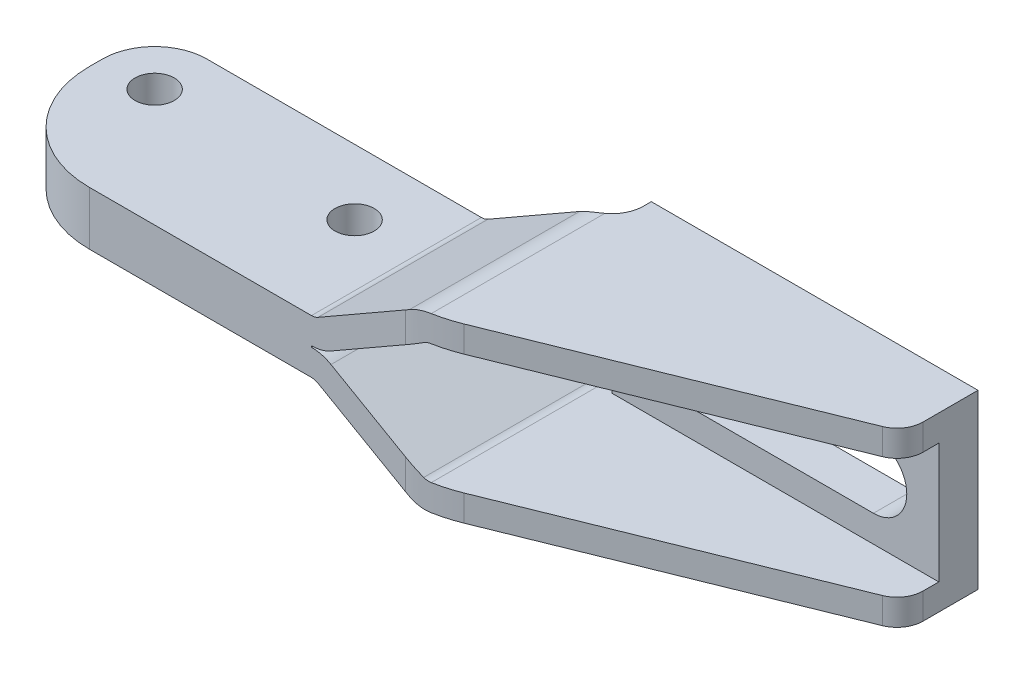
ISO-10303-21;
HEADER;
FILE_DESCRIPTION(('STEP AP214'),'2;1');
FILE_NAME('part.step','',(''),(''),'','','');
FILE_SCHEMA(('AUTOMOTIVE_DESIGN { 1 0 10303 214 1 1 1 1 }'));
ENDSEC;
DATA;
#1=APPLICATION_CONTEXT('core data for automotive mechanical design processes');
#2=APPLICATION_PROTOCOL_DEFINITION('international standard','automotive_design',2000,#1);
#3=PRODUCT_CONTEXT('',#1,'mechanical');
#4=PRODUCT('Part','Part','',(#3));
#5=PRODUCT_RELATED_PRODUCT_CATEGORY('part','',(#4));
#6=PRODUCT_DEFINITION_FORMATION('','',#4);
#7=PRODUCT_DEFINITION_CONTEXT('part definition',#1,'design');
#8=PRODUCT_DEFINITION('design','',#6,#7);
#9=PRODUCT_DEFINITION_SHAPE('','',#8);
#10=(LENGTH_UNIT() NAMED_UNIT(*) SI_UNIT(.MILLI.,.METRE.));
#11=(NAMED_UNIT(*) PLANE_ANGLE_UNIT() SI_UNIT($,.RADIAN.));
#12=(NAMED_UNIT(*) SI_UNIT($,.STERADIAN.) SOLID_ANGLE_UNIT());
#13=UNCERTAINTY_MEASURE_WITH_UNIT(LENGTH_MEASURE(1.E-05),#10,'distance_accuracy_value','');
#14=(GEOMETRIC_REPRESENTATION_CONTEXT(3) GLOBAL_UNCERTAINTY_ASSIGNED_CONTEXT((#13)) GLOBAL_UNIT_ASSIGNED_CONTEXT((#10,
#11,#12)) REPRESENTATION_CONTEXT('',''));
#15=CARTESIAN_POINT('',(0.,0.,0.));
#16=DIRECTION('',(0.,0.,1.));
#17=DIRECTION('',(1.,0.,0.));
#18=AXIS2_PLACEMENT_3D('',#15,#16,#17);
#19=CARTESIAN_POINT('',(-6.,2.05,11.));
#20=DIRECTION('',(0.,1.,0.));
#21=DIRECTION('',(0.,0.,-1.));
#22=AXIS2_PLACEMENT_3D('',#19,#20,#21);
#23=PLANE('',#22);
#24=CARTESIAN_POINT('',(0.,2.05,0.));
#25=DIRECTION('',(0.,1.,0.));
#26=DIRECTION('',(-1.,0.,0.));
#27=AXIS2_PLACEMENT_3D('',#24,#25,#26);
#28=CIRCLE('',#27,1.5);
#29=CARTESIAN_POINT('',(-1.5,2.05,0.));
#30=VERTEX_POINT('',#29);
#31=EDGE_CURVE('E308',#30,#30,#28,.T.);
#32=ORIENTED_EDGE('',*,*,#31,.F.);
#33=EDGE_LOOP('',(#32));
#34=FACE_BOUND('',#33,.T.);
#35=CARTESIAN_POINT('',(0.,2.05,0.));
#36=DIRECTION('',(0.,1.,0.));
#37=DIRECTION('',(0.,0.,-1.));
#38=AXIS2_PLACEMENT_3D('',#35,#36,#37);
#39=CIRCLE('',#38,4.);
#40=CARTESIAN_POINT('',(-4.,2.05,0.));
#41=VERTEX_POINT('',#40);
#42=CARTESIAN_POINT('',(0.,2.05,-4.));
#43=VERTEX_POINT('',#42);
#44=EDGE_CURVE('E501',#41,#43,#39,.F.);
#45=ORIENTED_EDGE('',*,*,#44,.F.);
#46=DIRECTION('',(0.,0.,-1.));
#47=VECTOR('',#46,1.);
#48=CARTESIAN_POINT('',(-4.,2.05,0.));
#49=LINE('',#48,#47);
#50=CARTESIAN_POINT('',(-4.,2.05,1.));
#51=VERTEX_POINT('',#50);
#52=EDGE_CURVE('E498',#51,#41,#49,.T.);
#53=ORIENTED_EDGE('',*,*,#52,.F.);
#54=CARTESIAN_POINT('',(3.99999999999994,2.05,1.00000000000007));
#55=DIRECTION('',(0.,1.,0.));
#56=DIRECTION('',(0.,0.,-1.));
#57=AXIS2_PLACEMENT_3D('',#54,#55,#56);
#58=CIRCLE('',#57,8.);
#59=CARTESIAN_POINT('',(4.,2.05,9.));
#60=VERTEX_POINT('',#59);
#61=EDGE_CURVE('E495',#60,#51,#58,.F.);
#62=ORIENTED_EDGE('',*,*,#61,.F.);
#63=DIRECTION('',(-1.,0.,0.));
#64=VECTOR('',#63,1.);
#65=CARTESIAN_POINT('',(4.,2.05,9.));
#66=LINE('',#65,#64);
#67=CARTESIAN_POINT('',(21.,2.05,9.));
#68=VERTEX_POINT('',#67);
#69=EDGE_CURVE('E660',#68,#60,#66,.T.);
#70=ORIENTED_EDGE('',*,*,#69,.F.);
#71=DIRECTION('',(0.,0.,-1.));
#72=VECTOR('',#71,1.);
#73=CARTESIAN_POINT('',(21.,2.05,11.));
#74=LINE('',#73,#72);
#75=CARTESIAN_POINT('',(21.,2.05,-4.));
#76=VERTEX_POINT('',#75);
#77=EDGE_CURVE('E450',#68,#76,#74,.T.);
#78=ORIENTED_EDGE('',*,*,#77,.T.);
#79=DIRECTION('',(1.,0.,0.));
#80=VECTOR('',#79,1.);
#81=CARTESIAN_POINT('',(28.6,2.05,-4.));
#82=LINE('',#81,#80);
#83=EDGE_CURVE('E504',#43,#76,#82,.T.);
#84=ORIENTED_EDGE('',*,*,#83,.F.);
#85=EDGE_LOOP('',(#45,#53,#62,#70,#78,#84));
#86=FACE_BOUND('',#85,.T.);
#87=CARTESIAN_POINT('',(16.3,2.05,1.));
#88=DIRECTION('',(0.,1.,0.));
#89=DIRECTION('',(-1.,0.,0.));
#90=AXIS2_PLACEMENT_3D('',#87,#88,#89);
#91=CIRCLE('',#90,1.5);
#92=CARTESIAN_POINT('',(14.8,2.05,1.));
#93=VERTEX_POINT('',#92);
#94=EDGE_CURVE('E300',#93,#93,#91,.T.);
#95=ORIENTED_EDGE('',*,*,#94,.F.);
#96=EDGE_LOOP('',(#95));
#97=FACE_BOUND('',#96,.T.);
#98=ADVANCED_FACE('F14',(#34,#86,#97),#23,.T.);
#99=CARTESIAN_POINT('',(28.6000000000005,-6.6,-6.39999999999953));
#100=DIRECTION('',(0.,1.,0.));
#101=DIRECTION('',(-1.,0.,0.));
#102=AXIS2_PLACEMENT_3D('',#99,#100,#101);
#103=CYLINDRICAL_SURFACE('',#102,2.39999999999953);
#104=CARTESIAN_POINT('',(28.6000000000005,4.6,-6.39999999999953));
#105=DIRECTION('',(0.,1.,0.));
#106=DIRECTION('',(-1.,0.,0.));
#107=AXIS2_PLACEMENT_3D('',#104,#105,#106);
#108=CIRCLE('',#107,2.39999999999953);
#109=CARTESIAN_POINT('',(30.,4.6,-4.45064113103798));
#110=VERTEX_POINT('',#109);
#111=CARTESIAN_POINT('',(31.,4.6,-6.4));
#112=VERTEX_POINT('',#111);
#113=EDGE_CURVE('E386',#110,#112,#108,.T.);
#114=ORIENTED_EDGE('',*,*,#113,.F.);
#115=CARTESIAN_POINT('',(29.502542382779,4.4674882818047,-4.17617058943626));
#116=CARTESIAN_POINT('',(29.5275809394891,4.4818492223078,-4.18632950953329));
#117=CARTESIAN_POINT('',(29.553019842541,4.4949929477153,-4.19715026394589));
#118=CARTESIAN_POINT('',(29.6044126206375,4.51886480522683,-4.22010423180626));
#119=CARTESIAN_POINT('',(29.6303661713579,4.52959440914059,-4.23223663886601));
#120=CARTESIAN_POINT('',(29.7074529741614,4.55778836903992,-4.27003334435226));
#121=CARTESIAN_POINT('',(29.7589540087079,4.57189392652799,-4.29755216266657));
#122=CARTESIAN_POINT('',(29.842011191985,4.587986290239,-4.34602772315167));
#123=CARTESIAN_POINT('',(29.8739067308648,4.5925250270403,-4.36565291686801));
#124=CARTESIAN_POINT('',(29.937388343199,4.59855271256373,-4.40679963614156));
#125=CARTESIAN_POINT('',(29.9689639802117,4.59999846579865,-4.42834369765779));
#126=CARTESIAN_POINT('',(30.,4.6,-4.45064113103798));
#127=B_SPLINE_CURVE_WITH_KNOTS('',3,(#115,#116,#117,#118,#119,#120,#121,#122,#123,#124,#125,
#126),.UNSPECIFIED.,.F.,.F.,(4,2,2,2,2,4),(0.,0.0917232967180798,0.183390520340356,
0.362632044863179,0.475655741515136,0.590247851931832),.UNSPECIFIED.);
#128=CARTESIAN_POINT('',(29.502542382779,4.4674882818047,-4.17617058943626));
#129=VERTEX_POINT('',#128);
#130=EDGE_CURVE('E379',#129,#110,#127,.T.);
#131=ORIENTED_EDGE('',*,*,#130,.F.);
#132=CARTESIAN_POINT('',(28.6000000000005,3.94992903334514,-6.39999999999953));
#133=DIRECTION('',(-0.497457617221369,0.867488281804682,0.));
#134=DIRECTION('',(0.867488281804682,0.497457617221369,0.));
#135=AXIS2_PLACEMENT_3D('',#132,#133,#134);
#136=ELLIPSE('',#135,2.76660797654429,2.39999999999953);
#137=CARTESIAN_POINT('',(28.6,3.94992903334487,-4.));
#138=VERTEX_POINT('',#137);
#139=EDGE_CURVE('E387',#138,#129,#136,.T.);
#140=ORIENTED_EDGE('',*,*,#139,.F.);
#141=DIRECTION('',(0.,1.,0.));
#142=VECTOR('',#141,1.);
#143=CARTESIAN_POINT('',(28.6,-6.6,-4.));
#144=LINE('',#143,#142);
#145=CARTESIAN_POINT('',(28.6,6.2532998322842,-4.));
#146=VERTEX_POINT('',#145);
#147=EDGE_CURVE('E633',#138,#146,#144,.T.);
#148=ORIENTED_EDGE('',*,*,#147,.T.);
#149=CARTESIAN_POINT('',(28.6,6.2532998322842,-4.));
#150=CARTESIAN_POINT('',(28.6494979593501,6.27942843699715,-3.99999239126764));
#151=CARTESIAN_POINT('',(28.6997464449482,6.30415965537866,-4.00153142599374));
#152=CARTESIAN_POINT('',(28.8013896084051,6.35071696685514,-4.00792402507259));
#153=CARTESIAN_POINT('',(28.8527847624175,6.37254182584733,-4.01277899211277));
#154=CARTESIAN_POINT('',(28.956282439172,6.41313749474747,-4.02601977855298));
#155=CARTESIAN_POINT('',(29.0083843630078,6.43191073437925,-4.03440276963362));
#156=CARTESIAN_POINT('',(29.1128664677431,6.46636106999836,-4.05483328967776));
#157=CARTESIAN_POINT('',(29.1652465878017,6.4820388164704,-4.06688004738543));
#158=CARTESIAN_POINT('',(29.3224384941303,6.52449359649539,-4.10875156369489));
#159=CARTESIAN_POINT('',(29.4270811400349,6.54660682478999,-4.14428082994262));
#160=CARTESIAN_POINT('',(29.6317282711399,6.57911340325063,-4.23024432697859));
#161=CARTESIAN_POINT('',(29.7317404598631,6.58952694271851,-4.28065269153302));
#162=CARTESIAN_POINT('',(29.8573041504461,6.5967513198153,-4.35540371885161));
#163=CARTESIAN_POINT('',(29.8864260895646,6.59798773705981,-4.37360130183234));
#164=CARTESIAN_POINT('',(29.9438372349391,6.59961090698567,-4.41121316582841));
#165=CARTESIAN_POINT('',(29.9721275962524,6.59999889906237,-4.43062562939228));
#166=CARTESIAN_POINT('',(30.,6.6,-4.45064113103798));
#167=B_SPLINE_CURVE_WITH_KNOTS('',3,(#149,#150,#151,#152,#153,#154,#155,#156,#157,#158,#159,
#160,#161,#162,#163,#164,#165,#166),.UNSPECIFIED.,.F.,.F.,(4,2,2,2,2,2,2,2,4),(0.,
0.167885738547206,0.335842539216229,0.50366494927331,0.671452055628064,1.00773091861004,
1.34342859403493,1.44648743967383,1.54939563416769),.UNSPECIFIED.);
#168=CARTESIAN_POINT('',(30.,6.6,-4.45064113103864));
#169=VERTEX_POINT('',#168);
#170=EDGE_CURVE('E479',#146,#169,#167,.T.);
#171=ORIENTED_EDGE('',*,*,#170,.T.);
#172=CARTESIAN_POINT('',(28.6000000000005,6.6,-6.39999999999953));
#173=DIRECTION('',(0.,-1.,0.));
#174=DIRECTION('',(-1.,0.,0.));
#175=AXIS2_PLACEMENT_3D('',#172,#173,#174);
#176=CIRCLE('',#175,2.39999999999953);
#177=CARTESIAN_POINT('',(31.,6.6,-6.4));
#178=VERTEX_POINT('',#177);
#179=EDGE_CURVE('E575',#178,#169,#176,.T.);
#180=ORIENTED_EDGE('',*,*,#179,.F.);
#181=DIRECTION('',(0.,1.,0.));
#182=VECTOR('',#181,1.);
#183=CARTESIAN_POINT('',(31.,-6.6,-6.4));
#184=LINE('',#183,#182);
#185=EDGE_CURVE('E637',#112,#178,#184,.T.);
#186=ORIENTED_EDGE('',*,*,#185,.F.);
#187=EDGE_LOOP('',(#114,#131,#140,#148,#171,#180,#186));
#188=FACE_BOUND('',#187,.T.);
#189=ADVANCED_FACE('F766',(#188),#103,.F.);
#190=CARTESIAN_POINT('',(28.6,-6.6,-4.));
#191=DIRECTION('',(0.,0.,-1.));
#192=DIRECTION('',(0.,-1.,0.));
#193=AXIS2_PLACEMENT_3D('',#190,#191,#192);
#194=PLANE('',#193);
#195=CARTESIAN_POINT('',(21.0000000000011,-3.04999999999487,-4.));
#196=DIRECTION('',(0.,0.,-1.));
#197=DIRECTION('',(0.,-1.,0.));
#198=AXIS2_PLACEMENT_3D('',#195,#196,#197);
#199=CIRCLE('',#198,0.999999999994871);
#200=CARTESIAN_POINT('',(21.497457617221,-2.1825117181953,-4.));
#201=VERTEX_POINT('',#200);
#202=CARTESIAN_POINT('',(21.,-2.05,-4.));
#203=VERTEX_POINT('',#202);
#204=EDGE_CURVE('E566',#201,#203,#199,.F.);
#205=ORIENTED_EDGE('',*,*,#204,.T.);
#206=DIRECTION('',(-1.,0.,0.));
#207=VECTOR('',#206,1.);
#208=CARTESIAN_POINT('',(28.6,-2.05,-4.));
#209=LINE('',#208,#207);
#210=CARTESIAN_POINT('',(0.,-2.05,-4.));
#211=VERTEX_POINT('',#210);
#212=EDGE_CURVE('E563',#203,#211,#209,.T.);
#213=ORIENTED_EDGE('',*,*,#212,.T.);
#214=DIRECTION('',(0.,1.,0.));
#215=VECTOR('',#214,1.);
#216=CARTESIAN_POINT('',(0.,-6.6,-4.));
#217=LINE('',#216,#215);
#218=EDGE_CURVE('E631',#211,#43,#217,.T.);
#219=ORIENTED_EDGE('',*,*,#218,.T.);
#220=ORIENTED_EDGE('',*,*,#83,.T.);
#221=CARTESIAN_POINT('',(20.9999999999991,3.05000000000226,-4.));
#222=DIRECTION('',(0.,0.,-1.));
#223=DIRECTION('',(0.,-1.,0.));
#224=AXIS2_PLACEMENT_3D('',#221,#222,#223);
#225=CIRCLE('',#224,1.00000000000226);
#226=CARTESIAN_POINT('',(21.497457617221,2.1825117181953,-4.));
#227=VERTEX_POINT('',#226);
#228=EDGE_CURVE('E492',#76,#227,#225,.F.);
#229=ORIENTED_EDGE('',*,*,#228,.T.);
#230=DIRECTION('',(0.867488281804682,0.497457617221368,0.));
#231=VECTOR('',#230,1.);
#232=CARTESIAN_POINT('',(23.0523825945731,3.07417710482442,-4.));
#233=LINE('',#232,#231);
#234=CARTESIAN_POINT('',(28.507627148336,6.202464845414,-4.));
#235=VERTEX_POINT('',#234);
#236=EDGE_CURVE('E489',#227,#235,#233,.T.);
#237=ORIENTED_EDGE('',*,*,#236,.T.);
#238=CARTESIAN_POINT('',(30.0000000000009,3.59999999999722,-4.));
#239=DIRECTION('',(0.,0.,-1.));
#240=DIRECTION('',(0.,-1.,0.));
#241=AXIS2_PLACEMENT_3D('',#238,#239,#240);
#242=CIRCLE('',#241,3.00000000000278);
#243=EDGE_CURVE('E462',#235,#146,#242,.T.);
#244=ORIENTED_EDGE('',*,*,#243,.T.);
#245=ORIENTED_EDGE('',*,*,#147,.F.);
#246=DIRECTION('',(-0.867488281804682,-0.497457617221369,0.));
#247=VECTOR('',#246,1.);
#248=CARTESIAN_POINT('',(29.502542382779,4.4674882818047,-4.));
#249=LINE('',#248,#247);
#250=CARTESIAN_POINT('',(22.492372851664,0.447535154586,-4.));
#251=VERTEX_POINT('',#250);
#252=EDGE_CURVE('E397',#138,#251,#249,.T.);
#253=ORIENTED_EDGE('',*,*,#252,.T.);
#254=CARTESIAN_POINT('',(20.9999999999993,3.05000000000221,-4.));
#255=DIRECTION('',(0.,0.,-1.));
#256=DIRECTION('',(-1.,0.,0.));
#257=AXIS2_PLACEMENT_3D('',#254,#255,#256);
#258=CIRCLE('',#257,3.00000000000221);
#259=CARTESIAN_POINT('',(21.,0.05,-4.));
#260=VERTEX_POINT('',#259);
#261=EDGE_CURVE('E283',#251,#260,#258,.T.);
#262=ORIENTED_EDGE('',*,*,#261,.T.);
#263=DIRECTION('',(0.,-1.,0.));
#264=VECTOR('',#263,1.);
#265=CARTESIAN_POINT('',(21.,30.2280056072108,-4.));
#266=LINE('',#265,#264);
#267=CARTESIAN_POINT('',(21.,-0.0500000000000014,-4.));
#268=VERTEX_POINT('',#267);
#269=EDGE_CURVE('E288',#260,#268,#266,.T.);
#270=ORIENTED_EDGE('',*,*,#269,.T.);
#271=CARTESIAN_POINT('',(20.9999999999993,-3.05000000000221,-4.));
#272=DIRECTION('',(0.,0.,-1.));
#273=DIRECTION('',(-1.,0.,0.));
#274=AXIS2_PLACEMENT_3D('',#271,#272,#273);
#275=CIRCLE('',#274,3.00000000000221);
#276=CARTESIAN_POINT('',(22.492372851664,-0.447535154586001,-4.));
#277=VERTEX_POINT('',#276);
#278=EDGE_CURVE('E270',#268,#277,#275,.T.);
#279=ORIENTED_EDGE('',*,*,#278,.T.);
#280=DIRECTION('',(0.867488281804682,-0.497457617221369,0.));
#281=VECTOR('',#280,1.);
#282=CARTESIAN_POINT('',(22.492372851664,-0.447535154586,-4.));
#283=LINE('',#282,#281);
#284=CARTESIAN_POINT('',(28.6,-3.94992903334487,-4.));
#285=VERTEX_POINT('',#284);
#286=EDGE_CURVE('E282',#277,#285,#283,.T.);
#287=ORIENTED_EDGE('',*,*,#286,.T.);
#288=CARTESIAN_POINT('',(28.6,-6.2532998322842,-4.));
#289=VERTEX_POINT('',#288);
#290=EDGE_CURVE('E634',#289,#285,#144,.T.);
#291=ORIENTED_EDGE('',*,*,#290,.F.);
#292=CARTESIAN_POINT('',(30.0000000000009,-3.59999999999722,-4.));
#293=DIRECTION('',(0.,0.,-1.));
#294=DIRECTION('',(0.,-1.,0.));
#295=AXIS2_PLACEMENT_3D('',#292,#293,#294);
#296=CIRCLE('',#295,3.00000000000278);
#297=CARTESIAN_POINT('',(28.507627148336,-6.202464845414,-4.));
#298=VERTEX_POINT('',#297);
#299=EDGE_CURVE('E527',#289,#298,#296,.T.);
#300=ORIENTED_EDGE('',*,*,#299,.T.);
#301=DIRECTION('',(-0.867488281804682,0.497457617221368,0.));
#302=VECTOR('',#301,1.);
#303=CARTESIAN_POINT('',(28.7486928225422,-6.34070297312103,-4.));
#304=LINE('',#303,#302);
#305=EDGE_CURVE('E551',#298,#201,#304,.T.);
#306=ORIENTED_EDGE('',*,*,#305,.T.);
#307=EDGE_LOOP('',(#205,#213,#219,#220,#229,#237,#244,#245,#253,#262,#270,#279,#287,#291,#300,#306));
#308=FACE_BOUND('',#307,.T.);
#309=ADVANCED_FACE('F296',(#308),#194,.T.);
#310=CARTESIAN_POINT('',(0.,-6.6,0.));
#311=DIRECTION('',(0.,1.,0.));
#312=DIRECTION('',(-1.,0.,0.));
#313=AXIS2_PLACEMENT_3D('',#310,#311,#312);
#314=CYLINDRICAL_SURFACE('',#313,4.);
#315=DIRECTION('',(0.,1.,0.));
#316=VECTOR('',#315,1.);
#317=CARTESIAN_POINT('',(-4.,-6.6,0.));
#318=LINE('',#317,#316);
#319=CARTESIAN_POINT('',(-4.,-2.05,0.));
#320=VERTEX_POINT('',#319);
#321=EDGE_CURVE('E629',#320,#41,#318,.T.);
#322=ORIENTED_EDGE('',*,*,#321,.T.);
#323=ORIENTED_EDGE('',*,*,#44,.T.);
#324=ORIENTED_EDGE('',*,*,#218,.F.);
#325=CARTESIAN_POINT('',(0.,-2.05,0.));
#326=DIRECTION('',(0.,-1.,0.));
#327=DIRECTION('',(0.,0.,1.));
#328=AXIS2_PLACEMENT_3D('',#325,#326,#327);
#329=CIRCLE('',#328,4.);
#330=EDGE_CURVE('E560',#211,#320,#329,.F.);
#331=ORIENTED_EDGE('',*,*,#330,.T.);
#332=EDGE_LOOP('',(#322,#323,#324,#331));
#333=FACE_BOUND('',#332,.T.);
#334=ADVANCED_FACE('F831',(#333),#314,.T.);
#335=CARTESIAN_POINT('',(-4.,-6.6,0.));
#336=DIRECTION('',(-1.,0.,0.));
#337=DIRECTION('',(0.,-1.,0.));
#338=AXIS2_PLACEMENT_3D('',#335,#336,#337);
#339=PLANE('',#338);
#340=DIRECTION('',(0.,1.,0.));
#341=VECTOR('',#340,1.);
#342=CARTESIAN_POINT('',(-4.,-6.6,1.));
#343=LINE('',#342,#341);
#344=CARTESIAN_POINT('',(-4.,-2.05,1.));
#345=VERTEX_POINT('',#344);
#346=EDGE_CURVE('E627',#345,#51,#343,.T.);
#347=ORIENTED_EDGE('',*,*,#346,.T.);
#348=ORIENTED_EDGE('',*,*,#52,.T.);
#349=ORIENTED_EDGE('',*,*,#321,.F.);
#350=DIRECTION('',(0.,0.,1.));
#351=VECTOR('',#350,1.);
#352=CARTESIAN_POINT('',(-4.,-2.05,0.));
#353=LINE('',#352,#351);
#354=EDGE_CURVE('E557',#320,#345,#353,.T.);
#355=ORIENTED_EDGE('',*,*,#354,.T.);
#356=EDGE_LOOP('',(#347,#348,#349,#355));
#357=FACE_BOUND('',#356,.T.);
#358=ADVANCED_FACE('F824',(#357),#339,.T.);
#359=CARTESIAN_POINT('',(3.99999999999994,-6.6,1.00000000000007));
#360=DIRECTION('',(0.,1.,0.));
#361=DIRECTION('',(-1.,0.,0.));
#362=AXIS2_PLACEMENT_3D('',#359,#360,#361);
#363=CYLINDRICAL_SURFACE('',#362,8.);
#364=DIRECTION('',(0.,1.,0.));
#365=VECTOR('',#364,1.);
#366=CARTESIAN_POINT('',(4.,-6.6,9.));
#367=LINE('',#366,#365);
#368=CARTESIAN_POINT('',(4.,-2.05,9.));
#369=VERTEX_POINT('',#368);
#370=EDGE_CURVE('E625',#369,#60,#367,.T.);
#371=ORIENTED_EDGE('',*,*,#370,.T.);
#372=ORIENTED_EDGE('',*,*,#61,.T.);
#373=ORIENTED_EDGE('',*,*,#346,.F.);
#374=CARTESIAN_POINT('',(3.99999999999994,-2.05,1.00000000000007));
#375=DIRECTION('',(0.,-1.,0.));
#376=DIRECTION('',(0.,0.,1.));
#377=AXIS2_PLACEMENT_3D('',#374,#375,#376);
#378=CIRCLE('',#377,8.);
#379=EDGE_CURVE('E554',#345,#369,#378,.F.);
#380=ORIENTED_EDGE('',*,*,#379,.T.);
#381=EDGE_LOOP('',(#371,#372,#373,#380));
#382=FACE_BOUND('',#381,.T.);
#383=ADVANCED_FACE('F820',(#382),#363,.T.);
#384=CARTESIAN_POINT('',(4.,-6.6,9.));
#385=DIRECTION('',(0.,0.,1.));
#386=DIRECTION('',(0.,1.,0.));
#387=AXIS2_PLACEMENT_3D('',#384,#385,#386);
#388=PLANE('',#387);
#389=CARTESIAN_POINT('',(20.9999999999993,-3.05000000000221,9.));
#390=DIRECTION('',(0.,0.,1.));
#391=DIRECTION('',(0.,1.,0.));
#392=AXIS2_PLACEMENT_3D('',#389,#390,#391);
#393=CIRCLE('',#392,3.00000000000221);
#394=CARTESIAN_POINT('',(22.492372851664,-0.447535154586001,9.));
#395=VERTEX_POINT('',#394);
#396=CARTESIAN_POINT('',(21.,-0.05,9.));
#397=VERTEX_POINT('',#396);
#398=EDGE_CURVE('E22',#395,#397,#393,.T.);
#399=ORIENTED_EDGE('',*,*,#398,.T.);
#400=DIRECTION('',(0.,-1.,0.));
#401=VECTOR('',#400,1.);
#402=CARTESIAN_POINT('',(21.,30.2280056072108,9.));
#403=LINE('',#402,#401);
#404=CARTESIAN_POINT('',(21.,0.0500000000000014,9.));
#405=VERTEX_POINT('',#404);
#406=EDGE_CURVE('E291',#405,#397,#403,.T.);
#407=ORIENTED_EDGE('',*,*,#406,.F.);
#408=CARTESIAN_POINT('',(20.9999999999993,3.05000000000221,9.));
#409=DIRECTION('',(0.,0.,1.));
#410=DIRECTION('',(0.,1.,0.));
#411=AXIS2_PLACEMENT_3D('',#408,#409,#410);
#412=CIRCLE('',#411,3.00000000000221);
#413=CARTESIAN_POINT('',(22.492372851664,0.447535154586,9.));
#414=VERTEX_POINT('',#413);
#415=EDGE_CURVE('E9',#405,#414,#412,.T.);
#416=ORIENTED_EDGE('',*,*,#415,.T.);
#417=DIRECTION('',(0.867488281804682,0.497457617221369,0.));
#418=VECTOR('',#417,1.);
#419=CARTESIAN_POINT('',(5.53491421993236,-9.27665033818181,9.));
#420=LINE('',#419,#418);
#421=CARTESIAN_POINT('',(28.189106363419,3.71430375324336,9.));
#422=VERTEX_POINT('',#421);
#423=EDGE_CURVE('E439',#414,#422,#420,.T.);
#424=ORIENTED_EDGE('',*,*,#423,.T.);
#425=DIRECTION('',(0.,1.,0.));
#426=VECTOR('',#425,1.);
#427=CARTESIAN_POINT('',(28.189106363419,-6.6,9.));
#428=LINE('',#427,#426);
#429=CARTESIAN_POINT('',(28.189106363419,6.01981040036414,9.));
#430=VERTEX_POINT('',#429);
#431=EDGE_CURVE('E621',#422,#430,#428,.T.);
#432=ORIENTED_EDGE('',*,*,#431,.T.);
#433=DIRECTION('',(-0.867488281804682,-0.497457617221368,0.));
#434=VECTOR('',#433,1.);
#435=CARTESIAN_POINT('',(4.53999898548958,-7.54167377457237,9.));
#436=LINE('',#435,#434);
#437=CARTESIAN_POINT('',(21.497457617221,2.1825117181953,9.));
#438=VERTEX_POINT('',#437);
#439=EDGE_CURVE('E486',#430,#438,#436,.T.);
#440=ORIENTED_EDGE('',*,*,#439,.T.);
#441=CARTESIAN_POINT('',(20.9999999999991,3.05000000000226,9.));
#442=DIRECTION('',(0.,0.,1.));
#443=DIRECTION('',(0.,1.,0.));
#444=AXIS2_PLACEMENT_3D('',#441,#442,#443);
#445=CIRCLE('',#444,1.00000000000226);
#446=EDGE_CURVE('E657',#438,#68,#445,.F.);
#447=ORIENTED_EDGE('',*,*,#446,.T.);
#448=ORIENTED_EDGE('',*,*,#69,.T.);
#449=ORIENTED_EDGE('',*,*,#370,.F.);
#450=DIRECTION('',(1.,0.,0.));
#451=VECTOR('',#450,1.);
#452=CARTESIAN_POINT('',(4.,-2.05,9.));
#453=LINE('',#452,#451);
#454=CARTESIAN_POINT('',(21.,-2.05,9.));
#455=VERTEX_POINT('',#454);
#456=EDGE_CURVE('E648',#369,#455,#453,.T.);
#457=ORIENTED_EDGE('',*,*,#456,.T.);
#458=CARTESIAN_POINT('',(21.0000000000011,-3.04999999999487,9.));
#459=DIRECTION('',(0.,0.,1.));
#460=DIRECTION('',(0.,1.,0.));
#461=AXIS2_PLACEMENT_3D('',#458,#459,#460);
#462=CIRCLE('',#461,0.999999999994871);
#463=CARTESIAN_POINT('',(21.497457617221,-2.1825117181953,9.));
#464=VERTEX_POINT('',#463);
#465=EDGE_CURVE('E651',#455,#464,#462,.F.);
#466=ORIENTED_EDGE('',*,*,#465,.T.);
#467=DIRECTION('',(0.867488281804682,-0.497457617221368,0.));
#468=VECTOR('',#467,1.);
#469=CARTESIAN_POINT('',(10.2363092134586,4.27514790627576,9.));
#470=LINE('',#469,#468);
#471=CARTESIAN_POINT('',(28.189106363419,-6.01981040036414,9.));
#472=VERTEX_POINT('',#471);
#473=EDGE_CURVE('E548',#464,#472,#470,.T.);
#474=ORIENTED_EDGE('',*,*,#473,.T.);
#475=CARTESIAN_POINT('',(28.189106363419,-3.71430375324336,9.));
#476=VERTEX_POINT('',#475);
#477=EDGE_CURVE('E622',#472,#476,#428,.T.);
#478=ORIENTED_EDGE('',*,*,#477,.T.);
#479=DIRECTION('',(-0.867488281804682,0.497457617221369,0.));
#480=VECTOR('',#479,1.);
#481=CARTESIAN_POINT('',(11.2312244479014,6.01012446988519,9.));
#482=LINE('',#481,#480);
#483=EDGE_CURVE('E436',#476,#395,#482,.T.);
#484=ORIENTED_EDGE('',*,*,#483,.T.);
#485=EDGE_LOOP('',(#399,#407,#416,#424,#432,#440,#447,#448,#449,#457,#466,#474,#478,#484));
#486=FACE_BOUND('',#485,.T.);
#487=ADVANCED_FACE('F714',(#486),#388,.T.);
#488=CARTESIAN_POINT('',(28.1891063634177,-6.6,-1.00000000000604));
#489=DIRECTION('',(0.,1.,0.));
#490=DIRECTION('',(-1.,0.,0.));
#491=AXIS2_PLACEMENT_3D('',#488,#489,#490);
#492=CYLINDRICAL_SURFACE('',#491,10.000000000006);
#493=CARTESIAN_POINT('',(29.502542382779,4.4674882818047,8.91336904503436));
#494=CARTESIAN_POINT('',(29.5273955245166,4.48173908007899,8.91007649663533));
#495=CARTESIAN_POINT('',(29.5528274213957,4.49490358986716,8.90661141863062));
#496=CARTESIAN_POINT('',(29.6046893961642,4.51899334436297,8.89933386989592));
#497=CARTESIAN_POINT('',(29.6311196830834,4.52991811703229,8.89552132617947));
#498=CARTESIAN_POINT('',(29.7104540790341,4.55878815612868,8.88373922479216));
#499=CARTESIAN_POINT('',(29.7645274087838,4.57346960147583,8.87527792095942));
#500=CARTESIAN_POINT('',(29.8489616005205,4.58899085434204,8.86132817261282));
#501=CARTESIAN_POINT('',(29.8788419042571,4.59309046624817,8.85625270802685));
#502=CARTESIAN_POINT('',(29.9391492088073,4.5986105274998,8.8457249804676));
#503=CARTESIAN_POINT('',(29.9695785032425,4.59999884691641,8.84026898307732));
#504=CARTESIAN_POINT('',(30.,4.60000000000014,8.83466645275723));
#505=B_SPLINE_CURVE_WITH_KNOTS('',3,(#493,#494,#495,#496,#497,#498,#499,#500,#501,#502,#503,
#504),.UNSPECIFIED.,.F.,.F.,(4,2,2,2,2,4),(0.,0.086449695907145,0.172917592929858,
0.341991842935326,0.433641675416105,0.526371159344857),.UNSPECIFIED.);
#506=CARTESIAN_POINT('',(29.502542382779,4.4674882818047,8.91336904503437));
#507=VERTEX_POINT('',#506);
#508=CARTESIAN_POINT('',(30.,4.6,8.8346664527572));
#509=VERTEX_POINT('',#508);
#510=EDGE_CURVE('E706',#507,#509,#505,.T.);
#511=ORIENTED_EDGE('',*,*,#510,.T.);
#512=CARTESIAN_POINT('',(28.1891063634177,4.6,-1.00000000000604));
#513=DIRECTION('',(0.,-1.,0.));
#514=DIRECTION('',(1.,0.,0.));
#515=AXIS2_PLACEMENT_3D('',#512,#513,#514);
#516=CIRCLE('',#515,10.000000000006);
#517=CARTESIAN_POINT('',(31.935172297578,4.6,8.2718385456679));
#518=VERTEX_POINT('',#517);
#519=EDGE_CURVE('E424',#509,#518,#516,.F.);
#520=ORIENTED_EDGE('',*,*,#519,.T.);
#521=DIRECTION('',(0.,1.,0.));
#522=VECTOR('',#521,1.);
#523=CARTESIAN_POINT('',(31.935172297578,-6.6,8.2718385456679));
#524=LINE('',#523,#522);
#525=CARTESIAN_POINT('',(31.935172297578,6.6,8.2718385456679));
#526=VERTEX_POINT('',#525);
#527=EDGE_CURVE('E617',#518,#526,#524,.T.);
#528=ORIENTED_EDGE('',*,*,#527,.T.);
#529=CARTESIAN_POINT('',(28.1891063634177,6.6,-1.00000000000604));
#530=DIRECTION('',(0.,1.,0.));
#531=DIRECTION('',(-1.,0.,0.));
#532=AXIS2_PLACEMENT_3D('',#529,#530,#531);
#533=CIRCLE('',#532,10.000000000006);
#534=CARTESIAN_POINT('',(30.0000000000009,6.6,8.83466645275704));
#535=VERTEX_POINT('',#534);
#536=EDGE_CURVE('E578',#535,#526,#533,.T.);
#537=ORIENTED_EDGE('',*,*,#536,.F.);
#538=CARTESIAN_POINT('',(30.,6.6,8.83466645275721));
#539=CARTESIAN_POINT('',(29.9186137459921,6.60001090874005,8.84966248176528));
#540=CARTESIAN_POINT('',(29.8370330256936,6.59668837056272,8.86362992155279));
#541=CARTESIAN_POINT('',(29.6740593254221,6.58335922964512,8.88947275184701));
#542=CARTESIAN_POINT('',(29.5926664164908,6.57335041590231,8.90134744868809));
#543=CARTESIAN_POINT('',(29.4325072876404,6.54692972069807,8.92271874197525));
#544=CARTESIAN_POINT('',(29.3537229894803,6.53066574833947,8.93226250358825));
#545=CARTESIAN_POINT('',(29.1975460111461,6.49180610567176,8.9493326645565));
#546=CARTESIAN_POINT('',(29.1201527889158,6.46921296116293,8.95685986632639));
#547=CARTESIAN_POINT('',(28.9515178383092,6.41249610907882,8.9713222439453));
#548=CARTESIAN_POINT('',(28.8607113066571,6.37695541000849,8.9778152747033));
#549=CARTESIAN_POINT('',(28.681631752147,6.29661063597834,8.98827609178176));
#550=CARTESIAN_POINT('',(28.593410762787,6.25168586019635,8.99220791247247));
#551=CARTESIAN_POINT('',(28.507627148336,6.202464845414,8.99492593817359));
#552=B_SPLINE_CURVE_WITH_KNOTS('',3,(#538,#539,#540,#541,#542,#543,#544,#545,#546,#547,#548,
#549,#550,#551),.UNSPECIFIED.,.F.,.F.,(4,2,2,2,2,2,4),(0.,0.248203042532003,0.496488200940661,
0.73923140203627,0.981877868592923,1.27455964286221,1.57126751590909),.UNSPECIFIED.);
#553=CARTESIAN_POINT('',(28.507627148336,6.202464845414,8.99492593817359));
#554=VERTEX_POINT('',#553);
#555=EDGE_CURVE('E453',#535,#554,#552,.T.);
#556=ORIENTED_EDGE('',*,*,#555,.T.);
#557=CARTESIAN_POINT('',(28.1891063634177,6.01981040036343,-1.00000000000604));
#558=DIRECTION('',(-0.497457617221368,0.867488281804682,0.));
#559=DIRECTION('',(0.867488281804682,0.497457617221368,0.));
#560=AXIS2_PLACEMENT_3D('',#557,#558,#559);
#561=ELLIPSE('',#560,11.5275332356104,10.000000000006);
#562=EDGE_CURVE('E654',#554,#430,#561,.F.);
#563=ORIENTED_EDGE('',*,*,#562,.T.);
#564=ORIENTED_EDGE('',*,*,#431,.F.);
#565=CARTESIAN_POINT('',(28.1891063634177,3.71430375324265,-1.00000000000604));
#566=DIRECTION('',(0.497457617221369,-0.867488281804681,0.));
#567=DIRECTION('',(0.867488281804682,0.497457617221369,0.));
#568=AXIS2_PLACEMENT_3D('',#565,#566,#567);
#569=ELLIPSE('',#568,11.5275332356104,10.000000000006);
#570=EDGE_CURVE('E712',#422,#507,#569,.F.);
#571=ORIENTED_EDGE('',*,*,#570,.T.);
#572=EDGE_LOOP('',(#511,#520,#528,#537,#556,#563,#564,#571));
#573=FACE_BOUND('',#572,.T.);
#574=ADVANCED_FACE('F464',(#573),#492,.T.);
#575=CARTESIAN_POINT('',(31.935172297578,-6.6,8.2718385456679));
#576=VERTEX_POINT('',#575);
#577=CARTESIAN_POINT('',(31.935172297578,-4.6,8.2718385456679));
#578=VERTEX_POINT('',#577);
#579=EDGE_CURVE('E618',#576,#578,#524,.T.);
#580=ORIENTED_EDGE('',*,*,#579,.T.);
#581=CARTESIAN_POINT('',(28.1891063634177,-4.6,-1.00000000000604));
#582=DIRECTION('',(0.,1.,0.));
#583=DIRECTION('',(-1.,0.,0.));
#584=AXIS2_PLACEMENT_3D('',#581,#582,#583);
#585=CIRCLE('',#584,10.000000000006);
#586=CARTESIAN_POINT('',(30.,-4.6,8.8346664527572));
#587=VERTEX_POINT('',#586);
#588=EDGE_CURVE('E433',#578,#587,#585,.F.);
#589=ORIENTED_EDGE('',*,*,#588,.T.);
#590=CARTESIAN_POINT('',(30.,-4.6,8.8346664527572));
#591=CARTESIAN_POINT('',(29.9716391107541,-4.59999856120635,8.83988924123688));
#592=CARTESIAN_POINT('',(29.9432719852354,-4.59879233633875,8.84498495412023));
#593=CARTESIAN_POINT('',(29.886684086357,-4.59396581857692,8.85490001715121));
#594=CARTESIAN_POINT('',(29.8584633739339,-4.59034459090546,8.8597192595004));
#595=CARTESIAN_POINT('',(29.7755546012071,-4.57607037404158,8.87351299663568));
#596=CARTESIAN_POINT('',(29.7213285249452,-4.562004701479,8.88206043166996));
#597=CARTESIAN_POINT('',(29.6400742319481,-4.5334742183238,8.89421723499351));
#598=CARTESIAN_POINT('',(29.6119656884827,-4.52214363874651,8.89829508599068));
#599=CARTESIAN_POINT('',(29.5565213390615,-4.49680833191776,8.90610769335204));
#600=CARTESIAN_POINT('',(29.5291986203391,-4.48277353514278,8.9098378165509));
#601=CARTESIAN_POINT('',(29.502542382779,-4.4674882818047,8.91336904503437));
#602=B_SPLINE_CURVE_WITH_KNOTS('',3,(#590,#591,#592,#593,#594,#595,#596,#597,#598,#599,#600,
#601),.UNSPECIFIED.,.F.,.F.,(4,2,2,2,2,4),(0.,0.0864536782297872,0.172940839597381,
0.34202420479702,0.433655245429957,0.526371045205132),.UNSPECIFIED.);
#603=CARTESIAN_POINT('',(29.502542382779,-4.4674882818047,8.91336904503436));
#604=VERTEX_POINT('',#603);
#605=EDGE_CURVE('E672',#587,#604,#602,.T.);
#606=ORIENTED_EDGE('',*,*,#605,.T.);
#607=CARTESIAN_POINT('',(28.1891063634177,-3.71430375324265,-1.00000000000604));
#608=DIRECTION('',(0.497457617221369,0.867488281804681,0.));
#609=DIRECTION('',(-0.867488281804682,0.497457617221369,0.));
#610=AXIS2_PLACEMENT_3D('',#607,#608,#609);
#611=ELLIPSE('',#610,11.5275332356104,10.000000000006);
#612=EDGE_CURVE('E679',#604,#476,#611,.F.);
#613=ORIENTED_EDGE('',*,*,#612,.T.);
#614=ORIENTED_EDGE('',*,*,#477,.F.);
#615=CARTESIAN_POINT('',(28.1891063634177,-6.01981040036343,-1.00000000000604));
#616=DIRECTION('',(-0.497457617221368,-0.867488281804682,0.));
#617=DIRECTION('',(-0.867488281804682,0.497457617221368,0.));
#618=AXIS2_PLACEMENT_3D('',#615,#616,#617);
#619=ELLIPSE('',#618,11.5275332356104,10.000000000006);
#620=CARTESIAN_POINT('',(28.507627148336,-6.202464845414,8.99492593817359));
#621=VERTEX_POINT('',#620);
#622=EDGE_CURVE('E645',#472,#621,#619,.F.);
#623=ORIENTED_EDGE('',*,*,#622,.T.);
#624=CARTESIAN_POINT('',(28.507627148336,-6.202464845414,8.99492593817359));
#625=CARTESIAN_POINT('',(28.5793837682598,-6.24362636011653,8.99264632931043));
#626=CARTESIAN_POINT('',(28.6528346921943,-6.28178970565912,8.98952522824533));
#627=CARTESIAN_POINT('',(28.8025689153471,-6.35190417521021,8.98144519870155));
#628=CARTESIAN_POINT('',(28.878852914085,-6.38385375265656,8.97648581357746));
#629=CARTESIAN_POINT('',(29.0319375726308,-6.44066460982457,8.96470793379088));
#630=CARTESIAN_POINT('',(29.1086889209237,-6.46566786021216,8.95793328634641));
#631=CARTESIAN_POINT('',(29.2637354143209,-6.50936438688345,8.94239636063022));
#632=CARTESIAN_POINT('',(29.3420299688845,-6.5280600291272,8.93363482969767));
#633=CARTESIAN_POINT('',(29.515899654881,-6.5622664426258,8.91205137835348));
#634=CARTESIAN_POINT('',(29.6117060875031,-6.57632341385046,8.89876464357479));
#635=CARTESIAN_POINT('',(29.8051008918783,-6.59526672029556,8.8690614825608));
#636=CARTESIAN_POINT('',(29.9026956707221,-6.60002451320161,8.85260459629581));
#637=CARTESIAN_POINT('',(30.,-6.6,8.83466645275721));
#638=B_SPLINE_CURVE_WITH_KNOTS('',3,(#624,#625,#626,#627,#628,#629,#630,#631,#632,#633,#634,
#635,#636,#637),.UNSPECIFIED.,.F.,.F.,(4,2,2,2,2,2,4),(0.,0.248193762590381,0.496449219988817,
0.739177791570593,0.981815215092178,1.27453278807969,1.57126874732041),.UNSPECIFIED.);
#639=CARTESIAN_POINT('',(30.,-6.6,8.83466645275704));
#640=VERTEX_POINT('',#639);
#641=EDGE_CURVE('E519',#621,#640,#638,.T.);
#642=ORIENTED_EDGE('',*,*,#641,.T.);
#643=CARTESIAN_POINT('',(28.1891063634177,-6.6,-1.00000000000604));
#644=DIRECTION('',(0.,1.,0.));
#645=DIRECTION('',(-1.,0.,0.));
#646=AXIS2_PLACEMENT_3D('',#643,#644,#645);
#647=CIRCLE('',#646,10.000000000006);
#648=EDGE_CURVE('E599',#640,#576,#647,.T.);
#649=ORIENTED_EDGE('',*,*,#648,.T.);
#650=EDGE_LOOP('',(#580,#589,#606,#613,#614,#623,#642,#649));
#651=FACE_BOUND('',#650,.T.);
#652=ADVANCED_FACE('F732',(#651),#492,.T.);
#653=CARTESIAN_POINT('',(56.,-6.6,-2.8));
#654=DIRECTION('',(1.,0.,0.));
#655=DIRECTION('',(0.,1.,0.));
#656=AXIS2_PLACEMENT_3D('',#653,#654,#655);
#657=PLANE('',#656);
#658=DIRECTION('',(0.,-1.,0.));
#659=VECTOR('',#658,1.);
#660=CARTESIAN_POINT('',(56.,-6.6,-4.));
#661=LINE('',#660,#659);
#662=CARTESIAN_POINT('',(56.,4.6,-4.));
#663=VERTEX_POINT('',#662);
#664=CARTESIAN_POINT('',(56.,-4.6,-4.));
#665=VERTEX_POINT('',#664);
#666=EDGE_CURVE('E669',#663,#665,#661,.T.);
#667=ORIENTED_EDGE('',*,*,#666,.T.);
#668=DIRECTION('',(0.,0.,1.));
#669=VECTOR('',#668,1.);
#670=CARTESIAN_POINT('',(56.,-4.6,-2.8));
#671=LINE('',#670,#669);
#672=CARTESIAN_POINT('',(56.,-4.6,-2.8));
#673=VERTEX_POINT('',#672);
#674=EDGE_CURVE('E430',#665,#673,#671,.T.);
#675=ORIENTED_EDGE('',*,*,#674,.T.);
#676=DIRECTION('',(0.,1.,0.));
#677=VECTOR('',#676,1.);
#678=CARTESIAN_POINT('',(56.,-6.6,-2.8));
#679=LINE('',#678,#677);
#680=CARTESIAN_POINT('',(56.,-6.6,-2.8));
#681=VERTEX_POINT('',#680);
#682=EDGE_CURVE('E610',#681,#673,#679,.T.);
#683=ORIENTED_EDGE('',*,*,#682,.F.);
#684=DIRECTION('',(0.,0.,-1.));
#685=VECTOR('',#684,1.);
#686=CARTESIAN_POINT('',(56.,-6.6,-2.8));
#687=LINE('',#686,#685);
#688=CARTESIAN_POINT('',(56.,-6.6,-7.));
#689=VERTEX_POINT('',#688);
#690=EDGE_CURVE('E587',#681,#689,#687,.T.);
#691=ORIENTED_EDGE('',*,*,#690,.T.);
#692=DIRECTION('',(0.,1.,0.));
#693=VECTOR('',#692,1.);
#694=CARTESIAN_POINT('',(56.,-6.6,-7.));
#695=LINE('',#694,#693);
#696=CARTESIAN_POINT('',(56.,6.6,-7.));
#697=VERTEX_POINT('',#696);
#698=EDGE_CURVE('E643',#689,#697,#695,.T.);
#699=ORIENTED_EDGE('',*,*,#698,.T.);
#700=DIRECTION('',(0.,0.,-1.));
#701=VECTOR('',#700,1.);
#702=CARTESIAN_POINT('',(56.,6.6,-2.8));
#703=LINE('',#702,#701);
#704=CARTESIAN_POINT('',(56.,6.6,-2.8));
#705=VERTEX_POINT('',#704);
#706=EDGE_CURVE('E568',#705,#697,#703,.T.);
#707=ORIENTED_EDGE('',*,*,#706,.F.);
#708=CARTESIAN_POINT('',(56.,4.6,-2.8));
#709=VERTEX_POINT('',#708);
#710=EDGE_CURVE('E607',#709,#705,#679,.T.);
#711=ORIENTED_EDGE('',*,*,#710,.F.);
#712=DIRECTION('',(0.,0.,-1.));
#713=VECTOR('',#712,1.);
#714=CARTESIAN_POINT('',(56.,4.6,-2.8));
#715=LINE('',#714,#713);
#716=EDGE_CURVE('E421',#709,#663,#715,.T.);
#717=ORIENTED_EDGE('',*,*,#716,.T.);
#718=EDGE_LOOP('',(#667,#675,#683,#691,#699,#707,#711,#717));
#719=FACE_BOUND('',#718,.T.);
#720=ADVANCED_FACE('F16',(#719),#657,.T.);
#721=CARTESIAN_POINT('',(31.935172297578,-6.6,8.2718385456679));
#722=DIRECTION('',(0.374606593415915,0.,0.927183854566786));
#723=DIRECTION('',(0.927183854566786,0.,-0.374606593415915));
#724=AXIS2_PLACEMENT_3D('',#721,#722,#723);
#725=PLANE('',#724);
#726=DIRECTION('',(0.,1.,0.));
#727=VECTOR('',#726,1.);
#728=CARTESIAN_POINT('',(54.749213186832,-6.6,-0.945632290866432));
#729=LINE('',#728,#727);
#730=CARTESIAN_POINT('',(54.749213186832,-6.6,-0.945632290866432));
#731=VERTEX_POINT('',#730);
#732=CARTESIAN_POINT('',(54.749213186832,-4.6,-0.945632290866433));
#733=VERTEX_POINT('',#732);
#734=EDGE_CURVE('E614',#731,#733,#729,.T.);
#735=ORIENTED_EDGE('',*,*,#734,.T.);
#736=DIRECTION('',(-0.927183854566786,0.,0.374606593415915));
#737=VECTOR('',#736,1.);
#738=CARTESIAN_POINT('',(31.935172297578,-4.6,8.2718385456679));
#739=LINE('',#738,#737);
#740=EDGE_CURVE('E427',#733,#578,#739,.T.);
#741=ORIENTED_EDGE('',*,*,#740,.T.);
#742=ORIENTED_EDGE('',*,*,#579,.F.);
#743=DIRECTION('',(0.927183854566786,0.,-0.374606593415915));
#744=VECTOR('',#743,1.);
#745=CARTESIAN_POINT('',(31.935172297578,-6.6,8.2718385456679));
#746=LINE('',#745,#744);
#747=EDGE_CURVE('E601',#576,#731,#746,.T.);
#748=ORIENTED_EDGE('',*,*,#747,.T.);
#749=EDGE_LOOP('',(#735,#741,#742,#748));
#750=FACE_BOUND('',#749,.T.);
#751=ADVANCED_FACE('F734',(#750),#725,.T.);
#752=ORIENTED_EDGE('',*,*,#527,.F.);
#753=DIRECTION('',(0.927183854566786,0.,-0.374606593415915));
#754=VECTOR('',#753,1.);
#755=CARTESIAN_POINT('',(31.935172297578,4.6,8.2718385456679));
#756=LINE('',#755,#754);
#757=CARTESIAN_POINT('',(54.749213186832,4.6,-0.945632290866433));
#758=VERTEX_POINT('',#757);
#759=EDGE_CURVE('E418',#518,#758,#756,.T.);
#760=ORIENTED_EDGE('',*,*,#759,.T.);
#761=CARTESIAN_POINT('',(54.749213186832,6.6,-0.945632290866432));
#762=VERTEX_POINT('',#761);
#763=EDGE_CURVE('E613',#758,#762,#729,.T.);
#764=ORIENTED_EDGE('',*,*,#763,.T.);
#765=DIRECTION('',(0.927183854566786,0.,-0.374606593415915));
#766=VECTOR('',#765,1.);
#767=CARTESIAN_POINT('',(31.935172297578,6.6,8.2718385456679));
#768=LINE('',#767,#766);
#769=EDGE_CURVE('E581',#526,#762,#768,.T.);
#770=ORIENTED_EDGE('',*,*,#769,.F.);
#771=EDGE_LOOP('',(#752,#760,#764,#770));
#772=FACE_BOUND('',#771,.T.);
#773=ADVANCED_FACE('F775',(#772),#725,.T.);
#774=CARTESIAN_POINT('',(54.,-6.6,-2.80000000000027));
#775=DIRECTION('',(0.,1.,0.));
#776=DIRECTION('',(-1.,0.,0.));
#777=AXIS2_PLACEMENT_3D('',#774,#775,#776);
#778=CYLINDRICAL_SURFACE('',#777,2.0000000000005);
#779=ORIENTED_EDGE('',*,*,#682,.T.);
#780=CARTESIAN_POINT('',(54.,-4.6,-2.80000000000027));
#781=DIRECTION('',(0.,1.,0.));
#782=DIRECTION('',(-1.,0.,0.));
#783=AXIS2_PLACEMENT_3D('',#780,#781,#782);
#784=CIRCLE('',#783,2.0000000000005);
#785=EDGE_CURVE('E666',#673,#733,#784,.F.);
#786=ORIENTED_EDGE('',*,*,#785,.T.);
#787=ORIENTED_EDGE('',*,*,#734,.F.);
#788=CARTESIAN_POINT('',(54.,-6.6,-2.80000000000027));
#789=DIRECTION('',(0.,1.,0.));
#790=DIRECTION('',(-1.,0.,0.));
#791=AXIS2_PLACEMENT_3D('',#788,#789,#790);
#792=CIRCLE('',#791,2.0000000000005);
#793=EDGE_CURVE('E604',#731,#681,#792,.T.);
#794=ORIENTED_EDGE('',*,*,#793,.T.);
#795=EDGE_LOOP('',(#779,#786,#787,#794));
#796=FACE_BOUND('',#795,.T.);
#797=ADVANCED_FACE('F739',(#796),#778,.T.);
#798=ORIENTED_EDGE('',*,*,#763,.F.);
#799=CARTESIAN_POINT('',(54.,4.6,-2.80000000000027));
#800=DIRECTION('',(0.,-1.,0.));
#801=DIRECTION('',(1.,0.,0.));
#802=AXIS2_PLACEMENT_3D('',#799,#800,#801);
#803=CIRCLE('',#802,2.0000000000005);
#804=EDGE_CURVE('E663',#758,#709,#803,.F.);
#805=ORIENTED_EDGE('',*,*,#804,.T.);
#806=ORIENTED_EDGE('',*,*,#710,.T.);
#807=CARTESIAN_POINT('',(54.,6.6,-2.80000000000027));
#808=DIRECTION('',(0.,1.,0.));
#809=DIRECTION('',(-1.,0.,0.));
#810=AXIS2_PLACEMENT_3D('',#807,#808,#809);
#811=CIRCLE('',#810,2.0000000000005);
#812=EDGE_CURVE('E584',#762,#705,#811,.T.);
#813=ORIENTED_EDGE('',*,*,#812,.F.);
#814=EDGE_LOOP('',(#798,#805,#806,#813));
#815=FACE_BOUND('',#814,.T.);
#816=ADVANCED_FACE('F780',(#815),#778,.T.);
#817=CARTESIAN_POINT('',(28.6000000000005,-4.6,-6.39999999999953));
#818=DIRECTION('',(0.,-1.,0.));
#819=DIRECTION('',(1.,0.,0.));
#820=AXIS2_PLACEMENT_3D('',#817,#818,#819);
#821=CIRCLE('',#820,2.39999999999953);
#822=CARTESIAN_POINT('',(31.,-4.6,-6.4));
#823=VERTEX_POINT('',#822);
#824=CARTESIAN_POINT('',(30.,-4.6,-4.45064113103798));
#825=VERTEX_POINT('',#824);
#826=EDGE_CURVE('E389',#823,#825,#821,.T.);
#827=ORIENTED_EDGE('',*,*,#826,.F.);
#828=CARTESIAN_POINT('',(31.,-6.6,-6.4));
#829=VERTEX_POINT('',#828);
#830=EDGE_CURVE('E638',#829,#823,#184,.T.);
#831=ORIENTED_EDGE('',*,*,#830,.F.);
#832=CARTESIAN_POINT('',(28.6000000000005,-6.6,-6.39999999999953));
#833=DIRECTION('',(0.,-1.,0.));
#834=DIRECTION('',(-1.,0.,0.));
#835=AXIS2_PLACEMENT_3D('',#832,#833,#834);
#836=CIRCLE('',#835,2.39999999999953);
#837=CARTESIAN_POINT('',(30.0000000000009,-6.6,-4.45064113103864));
#838=VERTEX_POINT('',#837);
#839=EDGE_CURVE('E596',#829,#838,#836,.T.);
#840=ORIENTED_EDGE('',*,*,#839,.T.);
#841=CARTESIAN_POINT('',(30.,-6.6,-4.45064113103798));
#842=CARTESIAN_POINT('',(29.9545546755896,-6.60000583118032,-4.41799227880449));
#843=CARTESIAN_POINT('',(29.9079500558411,-6.59896733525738,-4.38694157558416));
#844=CARTESIAN_POINT('',(29.8127529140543,-6.59452857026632,-4.32820144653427));
#845=CARTESIAN_POINT('',(29.764159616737,-6.59112737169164,-4.30051334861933));
#846=CARTESIAN_POINT('',(29.6653863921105,-6.58169292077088,-4.24870735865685));
#847=CARTESIAN_POINT('',(29.6152075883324,-6.57566149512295,-4.22458700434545));
#848=CARTESIAN_POINT('',(29.5136760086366,-6.5607647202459,-4.18002813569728));
#849=CARTESIAN_POINT('',(29.4623234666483,-6.55189993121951,-4.15958889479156));
#850=CARTESIAN_POINT('',(29.3068516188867,-6.52073425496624,-4.10381589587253));
#851=CARTESIAN_POINT('',(29.2015243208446,-6.49387986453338,-4.07413406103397));
#852=CARTESIAN_POINT('',(28.991873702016,-6.42767493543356,-4.02978668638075));
#853=CARTESIAN_POINT('',(28.8875489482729,-6.38834631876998,-4.01509499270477));
#854=CARTESIAN_POINT('',(28.7540753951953,-6.32926048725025,-4.00474208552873));
#855=CARTESIAN_POINT('',(28.7228944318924,-6.31480915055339,-4.00294771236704));
#856=CARTESIAN_POINT('',(28.6610547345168,-6.28484621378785,-4.00057829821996));
#857=CARTESIAN_POINT('',(28.6303953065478,-6.26933618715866,-4.00000148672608));
#858=CARTESIAN_POINT('',(28.6,-6.2532998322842,-4.));
#859=B_SPLINE_CURVE_WITH_KNOTS('',3,(#841,#842,#843,#844,#845,#846,#847,#848,#849,#850,#851,
#852,#853,#854,#855,#856,#857,#858),.UNSPECIFIED.,.F.,.F.,(4,2,2,2,2,2,2,2,4),(0.,
0.16784082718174,0.335747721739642,0.503538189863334,0.671295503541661,1.00749999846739,
1.34311689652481,1.44633072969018,1.54939437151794),.UNSPECIFIED.);
#860=EDGE_CURVE('E541',#838,#289,#859,.T.);
#861=ORIENTED_EDGE('',*,*,#860,.T.);
#862=ORIENTED_EDGE('',*,*,#290,.T.);
#863=CARTESIAN_POINT('',(28.6000000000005,-3.94992903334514,-6.39999999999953));
#864=DIRECTION('',(-0.497457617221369,-0.867488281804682,0.));
#865=DIRECTION('',(-0.867488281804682,0.497457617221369,0.));
#866=AXIS2_PLACEMENT_3D('',#863,#864,#865);
#867=ELLIPSE('',#866,2.76660797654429,2.39999999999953);
#868=CARTESIAN_POINT('',(29.502542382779,-4.4674882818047,-4.17617058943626));
#869=VERTEX_POINT('',#868);
#870=EDGE_CURVE('E363',#869,#285,#867,.T.);
#871=ORIENTED_EDGE('',*,*,#870,.F.);
#872=CARTESIAN_POINT('',(30.,-4.6,-4.45064113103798));
#873=CARTESIAN_POINT('',(29.974346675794,-4.5999971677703,-4.43221575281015));
#874=CARTESIAN_POINT('',(29.9483354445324,-4.59901121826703,-4.41430545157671));
#875=CARTESIAN_POINT('',(29.8957158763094,-4.59489951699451,-4.37957515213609));
#876=CARTESIAN_POINT('',(29.8691068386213,-4.59177111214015,-4.36275653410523));
#877=CARTESIAN_POINT('',(29.7899807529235,-4.57912584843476,-4.31489520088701));
#878=CARTESIAN_POINT('',(29.7368830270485,-4.56636303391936,-4.28553082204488));
#879=CARTESIAN_POINT('',(29.6535436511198,-4.53862081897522,-4.24332917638));
#880=CARTESIAN_POINT('',(29.6230873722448,-4.52683472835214,-4.22873732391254));
#881=CARTESIAN_POINT('',(29.5624093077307,-4.49979731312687,-4.20115932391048));
#882=CARTESIAN_POINT('',(29.5321965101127,-4.48450055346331,-4.18819802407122));
#883=CARTESIAN_POINT('',(29.502542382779,-4.4674882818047,-4.17617058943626));
#884=B_SPLINE_CURVE_WITH_KNOTS('',3,(#872,#873,#874,#875,#876,#877,#878,#879,#880,#881,#882,
#883),.UNSPECIFIED.,.F.,.F.,(4,2,2,2,2,4),(0.,0.0947065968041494,0.189530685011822,
0.374504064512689,0.481631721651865,0.590232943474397),.UNSPECIFIED.);
#885=EDGE_CURVE('E354',#825,#869,#884,.T.);
#886=ORIENTED_EDGE('',*,*,#885,.F.);
#887=EDGE_LOOP('',(#827,#831,#840,#861,#862,#871,#886));
#888=FACE_BOUND('',#887,.T.);
#889=ADVANCED_FACE('F365',(#888),#103,.F.);
#890=CARTESIAN_POINT('',(28.6000000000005,6.6,-6.39999999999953));
#891=DIRECTION('',(0.,-1.,0.));
#892=DIRECTION('',(1.,0.,0.));
#893=AXIS2_PLACEMENT_3D('',#890,#891,#892);
#894=PLANE('',#893);
#895=DIRECTION('',(0.,0.,-1.));
#896=VECTOR('',#895,1.);
#897=CARTESIAN_POINT('',(30.,6.6,11.));
#898=LINE('',#897,#896);
#899=EDGE_CURVE('E442',#535,#169,#898,.T.);
#900=ORIENTED_EDGE('',*,*,#899,.F.);
#901=ORIENTED_EDGE('',*,*,#536,.T.);
#902=ORIENTED_EDGE('',*,*,#769,.T.);
#903=ORIENTED_EDGE('',*,*,#812,.T.);
#904=ORIENTED_EDGE('',*,*,#706,.T.);
#905=DIRECTION('',(-1.,0.,0.));
#906=VECTOR('',#905,1.);
#907=CARTESIAN_POINT('',(56.,6.6,-7.));
#908=LINE('',#907,#906);
#909=CARTESIAN_POINT('',(31.,6.6,-7.));
#910=VERTEX_POINT('',#909);
#911=EDGE_CURVE('E569',#697,#910,#908,.T.);
#912=ORIENTED_EDGE('',*,*,#911,.T.);
#913=DIRECTION('',(0.,0.,1.));
#914=VECTOR('',#913,1.);
#915=CARTESIAN_POINT('',(31.,6.6,-7.));
#916=LINE('',#915,#914);
#917=EDGE_CURVE('E572',#910,#178,#916,.T.);
#918=ORIENTED_EDGE('',*,*,#917,.T.);
#919=ORIENTED_EDGE('',*,*,#179,.T.);
#920=EDGE_LOOP('',(#900,#901,#902,#903,#904,#912,#918,#919));
#921=FACE_BOUND('',#920,.T.);
#922=ADVANCED_FACE('F538',(#921),#894,.F.);
#923=CARTESIAN_POINT('',(28.6000000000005,-6.6,-6.39999999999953));
#924=DIRECTION('',(0.,-1.,0.));
#925=DIRECTION('',(1.,0.,0.));
#926=AXIS2_PLACEMENT_3D('',#923,#924,#925);
#927=PLANE('',#926);
#928=ORIENTED_EDGE('',*,*,#648,.F.);
#929=DIRECTION('',(0.,0.,-1.));
#930=VECTOR('',#929,1.);
#931=CARTESIAN_POINT('',(30.,-6.6,11.));
#932=LINE('',#931,#930);
#933=EDGE_CURVE('E516',#640,#838,#932,.T.);
#934=ORIENTED_EDGE('',*,*,#933,.T.);
#935=ORIENTED_EDGE('',*,*,#839,.F.);
#936=DIRECTION('',(0.,0.,1.));
#937=VECTOR('',#936,1.);
#938=CARTESIAN_POINT('',(31.,-6.6,-7.));
#939=LINE('',#938,#937);
#940=CARTESIAN_POINT('',(31.,-6.6,-7.));
#941=VERTEX_POINT('',#940);
#942=EDGE_CURVE('E593',#941,#829,#939,.T.);
#943=ORIENTED_EDGE('',*,*,#942,.F.);
#944=DIRECTION('',(-1.,0.,0.));
#945=VECTOR('',#944,1.);
#946=CARTESIAN_POINT('',(56.,-6.6,-7.));
#947=LINE('',#946,#945);
#948=EDGE_CURVE('E590',#689,#941,#947,.T.);
#949=ORIENTED_EDGE('',*,*,#948,.F.);
#950=ORIENTED_EDGE('',*,*,#690,.F.);
#951=ORIENTED_EDGE('',*,*,#793,.F.);
#952=ORIENTED_EDGE('',*,*,#747,.F.);
#953=EDGE_LOOP('',(#928,#934,#935,#943,#949,#950,#951,#952));
#954=FACE_BOUND('',#953,.T.);
#955=ADVANCED_FACE('F726',(#954),#927,.T.);
#956=CARTESIAN_POINT('',(56.,-6.6,-7.));
#957=DIRECTION('',(0.,0.,-1.));
#958=DIRECTION('',(0.,-1.,0.));
#959=AXIS2_PLACEMENT_3D('',#956,#957,#958);
#960=PLANE('',#959);
#961=DIRECTION('',(1.,0.,0.));
#962=VECTOR('',#961,1.);
#963=CARTESIAN_POINT('',(36.,-2.55,-7.));
#964=LINE('',#963,#962);
#965=CARTESIAN_POINT('',(36.,-2.55,-7.));
#966=VERTEX_POINT('',#965);
#967=CARTESIAN_POINT('',(51.,-2.55,-7.));
#968=VERTEX_POINT('',#967);
#969=EDGE_CURVE('E29',#966,#968,#964,.T.);
#970=ORIENTED_EDGE('',*,*,#969,.T.);
#971=CARTESIAN_POINT('',(51.,0.,-7.));
#972=DIRECTION('',(0.,0.,1.));
#973=DIRECTION('',(-1.,0.,0.));
#974=AXIS2_PLACEMENT_3D('',#971,#972,#973);
#975=CIRCLE('',#974,2.55);
#976=CARTESIAN_POINT('',(51.,2.55,-7.));
#977=VERTEX_POINT('',#976);
#978=EDGE_CURVE('E328',#968,#977,#975,.T.);
#979=ORIENTED_EDGE('',*,*,#978,.T.);
#980=DIRECTION('',(-1.,0.,0.));
#981=VECTOR('',#980,1.);
#982=CARTESIAN_POINT('',(51.,2.55,-7.));
#983=LINE('',#982,#981);
#984=CARTESIAN_POINT('',(36.,2.55,-7.));
#985=VERTEX_POINT('',#984);
#986=EDGE_CURVE('E331',#977,#985,#983,.T.);
#987=ORIENTED_EDGE('',*,*,#986,.T.);
#988=CARTESIAN_POINT('',(36.,0.,-7.));
#989=DIRECTION('',(0.,0.,1.));
#990=DIRECTION('',(1.,0.,0.));
#991=AXIS2_PLACEMENT_3D('',#988,#989,#990);
#992=CIRCLE('',#991,2.55);
#993=EDGE_CURVE('E334',#985,#966,#992,.T.);
#994=ORIENTED_EDGE('',*,*,#993,.T.);
#995=EDGE_LOOP('',(#970,#979,#987,#994));
#996=FACE_BOUND('',#995,.T.);
#997=DIRECTION('',(0.,1.,0.));
#998=VECTOR('',#997,1.);
#999=CARTESIAN_POINT('',(31.,-6.6,-7.));
#1000=LINE('',#999,#998);
#1001=EDGE_CURVE('E641',#941,#910,#1000,.T.);
#1002=ORIENTED_EDGE('',*,*,#1001,.T.);
#1003=ORIENTED_EDGE('',*,*,#911,.F.);
#1004=ORIENTED_EDGE('',*,*,#698,.F.);
#1005=ORIENTED_EDGE('',*,*,#948,.T.);
#1006=EDGE_LOOP('',(#1002,#1003,#1004,#1005));
#1007=FACE_BOUND('',#1006,.T.);
#1008=ADVANCED_FACE('F1180',(#996,#1007),#960,.T.);
#1009=CARTESIAN_POINT('',(31.,-6.6,-7.));
#1010=DIRECTION('',(-1.,0.,0.));
#1011=DIRECTION('',(0.,-1.,0.));
#1012=AXIS2_PLACEMENT_3D('',#1009,#1010,#1011);
#1013=PLANE('',#1012);
#1014=ORIENTED_EDGE('',*,*,#917,.F.);
#1015=ORIENTED_EDGE('',*,*,#1001,.F.);
#1016=ORIENTED_EDGE('',*,*,#942,.T.);
#1017=ORIENTED_EDGE('',*,*,#830,.T.);
#1018=DIRECTION('',(0.,0.,1.));
#1019=VECTOR('',#1018,1.);
#1020=CARTESIAN_POINT('',(31.,-4.6,-11.));
#1021=LINE('',#1020,#1019);
#1022=CARTESIAN_POINT('',(31.,-4.6,-4.));
#1023=VERTEX_POINT('',#1022);
#1024=EDGE_CURVE('E352',#823,#1023,#1021,.T.);
#1025=ORIENTED_EDGE('',*,*,#1024,.T.);
#1026=DIRECTION('',(0.,1.,0.));
#1027=VECTOR('',#1026,1.);
#1028=CARTESIAN_POINT('',(31.,-4.6,-4.));
#1029=LINE('',#1028,#1027);
#1030=CARTESIAN_POINT('',(31.,4.6,-4.));
#1031=VERTEX_POINT('',#1030);
#1032=EDGE_CURVE('E346',#1023,#1031,#1029,.T.);
#1033=ORIENTED_EDGE('',*,*,#1032,.T.);
#1034=DIRECTION('',(0.,0.,1.));
#1035=VECTOR('',#1034,1.);
#1036=CARTESIAN_POINT('',(31.,4.6,-11.));
#1037=LINE('',#1036,#1035);
#1038=EDGE_CURVE('E350',#112,#1031,#1037,.T.);
#1039=ORIENTED_EDGE('',*,*,#1038,.F.);
#1040=ORIENTED_EDGE('',*,*,#185,.T.);
#1041=EDGE_LOOP('',(#1014,#1015,#1016,#1017,#1025,#1033,#1039,#1040));
#1042=FACE_BOUND('',#1041,.T.);
#1043=ADVANCED_FACE('F535',(#1042),#1013,.T.);
#1044=CARTESIAN_POINT('',(30.0000000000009,-3.59999999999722,11.));
#1045=DIRECTION('',(0.,0.,-1.));
#1046=DIRECTION('',(0.,-1.,0.));
#1047=AXIS2_PLACEMENT_3D('',#1044,#1045,#1046);
#1048=CYLINDRICAL_SURFACE('',#1047,3.00000000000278);
#1049=ORIENTED_EDGE('',*,*,#933,.F.);
#1050=ORIENTED_EDGE('',*,*,#641,.F.);
#1051=DIRECTION('',(0.,0.,-1.));
#1052=VECTOR('',#1051,1.);
#1053=CARTESIAN_POINT('',(28.507627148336,-6.202464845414,11.));
#1054=LINE('',#1053,#1052);
#1055=EDGE_CURVE('E513',#621,#298,#1054,.T.);
#1056=ORIENTED_EDGE('',*,*,#1055,.T.);
#1057=ORIENTED_EDGE('',*,*,#299,.F.);
#1058=ORIENTED_EDGE('',*,*,#860,.F.);
#1059=EDGE_LOOP('',(#1049,#1050,#1056,#1057,#1058));
#1060=FACE_BOUND('',#1059,.T.);
#1061=ADVANCED_FACE('F529',(#1060),#1048,.T.);
#1062=CARTESIAN_POINT('',(28.507627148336,-6.202464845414,11.));
#1063=DIRECTION('',(-0.497457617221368,-0.867488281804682,0.));
#1064=DIRECTION('',(0.867488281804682,-0.497457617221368,0.));
#1065=AXIS2_PLACEMENT_3D('',#1062,#1063,#1064);
#1066=PLANE('',#1065);
#1067=ORIENTED_EDGE('',*,*,#1055,.F.);
#1068=ORIENTED_EDGE('',*,*,#622,.F.);
#1069=ORIENTED_EDGE('',*,*,#473,.F.);
#1070=DIRECTION('',(0.,0.,-1.));
#1071=VECTOR('',#1070,1.);
#1072=CARTESIAN_POINT('',(21.497457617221,-2.1825117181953,11.));
#1073=LINE('',#1072,#1071);
#1074=EDGE_CURVE('E510',#464,#201,#1073,.T.);
#1075=ORIENTED_EDGE('',*,*,#1074,.T.);
#1076=ORIENTED_EDGE('',*,*,#305,.F.);
#1077=EDGE_LOOP('',(#1067,#1068,#1069,#1075,#1076));
#1078=FACE_BOUND('',#1077,.T.);
#1079=ADVANCED_FACE('F534',(#1078),#1066,.T.);
#1080=CARTESIAN_POINT('',(21.0000000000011,-3.04999999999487,11.));
#1081=DIRECTION('',(0.,0.,-1.));
#1082=DIRECTION('',(0.,-1.,0.));
#1083=AXIS2_PLACEMENT_3D('',#1080,#1081,#1082);
#1084=CYLINDRICAL_SURFACE('',#1083,0.999999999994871);
#1085=ORIENTED_EDGE('',*,*,#1074,.F.);
#1086=ORIENTED_EDGE('',*,*,#465,.F.);
#1087=DIRECTION('',(0.,0.,-1.));
#1088=VECTOR('',#1087,1.);
#1089=CARTESIAN_POINT('',(21.,-2.05,11.));
#1090=LINE('',#1089,#1088);
#1091=EDGE_CURVE('E507',#455,#203,#1090,.T.);
#1092=ORIENTED_EDGE('',*,*,#1091,.T.);
#1093=ORIENTED_EDGE('',*,*,#204,.F.);
#1094=EDGE_LOOP('',(#1085,#1086,#1092,#1093));
#1095=FACE_BOUND('',#1094,.T.);
#1096=ADVANCED_FACE('F805',(#1095),#1084,.F.);
#1097=CARTESIAN_POINT('',(21.,-2.05,11.));
#1098=DIRECTION('',(0.,-1.,0.));
#1099=DIRECTION('',(0.,0.,1.));
#1100=AXIS2_PLACEMENT_3D('',#1097,#1098,#1099);
#1101=PLANE('',#1100);
#1102=CARTESIAN_POINT('',(16.3,-2.05,1.));
#1103=DIRECTION('',(0.,1.,0.));
#1104=DIRECTION('',(-1.,0.,0.));
#1105=AXIS2_PLACEMENT_3D('',#1102,#1103,#1104);
#1106=CIRCLE('',#1105,1.5);
#1107=CARTESIAN_POINT('',(14.8,-2.05,1.));
#1108=VERTEX_POINT('',#1107);
#1109=EDGE_CURVE('E305',#1108,#1108,#1106,.T.);
#1110=ORIENTED_EDGE('',*,*,#1109,.T.);
#1111=EDGE_LOOP('',(#1110));
#1112=FACE_BOUND('',#1111,.T.);
#1113=CARTESIAN_POINT('',(0.,-2.05,0.));
#1114=DIRECTION('',(0.,1.,0.));
#1115=DIRECTION('',(-1.,0.,0.));
#1116=AXIS2_PLACEMENT_3D('',#1113,#1114,#1115);
#1117=CIRCLE('',#1116,1.5);
#1118=CARTESIAN_POINT('',(-1.5,-2.05,0.));
#1119=VERTEX_POINT('',#1118);
#1120=EDGE_CURVE('E311',#1119,#1119,#1117,.T.);
#1121=ORIENTED_EDGE('',*,*,#1120,.T.);
#1122=EDGE_LOOP('',(#1121));
#1123=FACE_BOUND('',#1122,.T.);
#1124=ORIENTED_EDGE('',*,*,#1091,.F.);
#1125=ORIENTED_EDGE('',*,*,#456,.F.);
#1126=ORIENTED_EDGE('',*,*,#379,.F.);
#1127=ORIENTED_EDGE('',*,*,#354,.F.);
#1128=ORIENTED_EDGE('',*,*,#330,.F.);
#1129=ORIENTED_EDGE('',*,*,#212,.F.);
#1130=EDGE_LOOP('',(#1124,#1125,#1126,#1127,#1128,#1129));
#1131=FACE_BOUND('',#1130,.T.);
#1132=ADVANCED_FACE('F803',(#1112,#1123,#1131),#1101,.T.);
#1133=CARTESIAN_POINT('',(20.9999999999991,3.05000000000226,11.));
#1134=DIRECTION('',(0.,0.,-1.));
#1135=DIRECTION('',(0.,-1.,0.));
#1136=AXIS2_PLACEMENT_3D('',#1133,#1134,#1135);
#1137=CYLINDRICAL_SURFACE('',#1136,1.00000000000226);
#1138=ORIENTED_EDGE('',*,*,#77,.F.);
#1139=ORIENTED_EDGE('',*,*,#446,.F.);
#1140=DIRECTION('',(0.,0.,-1.));
#1141=VECTOR('',#1140,1.);
#1142=CARTESIAN_POINT('',(21.497457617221,2.1825117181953,11.));
#1143=LINE('',#1142,#1141);
#1144=EDGE_CURVE('E447',#438,#227,#1143,.T.);
#1145=ORIENTED_EDGE('',*,*,#1144,.T.);
#1146=ORIENTED_EDGE('',*,*,#228,.F.);
#1147=EDGE_LOOP('',(#1138,#1139,#1145,#1146));
#1148=FACE_BOUND('',#1147,.T.);
#1149=ADVANCED_FACE('F802',(#1148),#1137,.F.);
#1150=CARTESIAN_POINT('',(21.497457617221,2.1825117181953,11.));
#1151=DIRECTION('',(-0.497457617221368,0.867488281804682,0.));
#1152=DIRECTION('',(-0.867488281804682,-0.497457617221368,0.));
#1153=AXIS2_PLACEMENT_3D('',#1150,#1151,#1152);
#1154=PLANE('',#1153);
#1155=ORIENTED_EDGE('',*,*,#1144,.F.);
#1156=ORIENTED_EDGE('',*,*,#439,.F.);
#1157=ORIENTED_EDGE('',*,*,#562,.F.);
#1158=DIRECTION('',(0.,0.,-1.));
#1159=VECTOR('',#1158,1.);
#1160=CARTESIAN_POINT('',(28.507627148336,6.202464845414,11.));
#1161=LINE('',#1160,#1159);
#1162=EDGE_CURVE('E444',#554,#235,#1161,.T.);
#1163=ORIENTED_EDGE('',*,*,#1162,.T.);
#1164=ORIENTED_EDGE('',*,*,#236,.F.);
#1165=EDGE_LOOP('',(#1155,#1156,#1157,#1163,#1164));
#1166=FACE_BOUND('',#1165,.T.);
#1167=ADVANCED_FACE('F473',(#1166),#1154,.T.);
#1168=CARTESIAN_POINT('',(30.0000000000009,3.59999999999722,11.));
#1169=DIRECTION('',(0.,0.,-1.));
#1170=DIRECTION('',(0.,-1.,0.));
#1171=AXIS2_PLACEMENT_3D('',#1168,#1169,#1170);
#1172=CYLINDRICAL_SURFACE('',#1171,3.00000000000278);
#1173=ORIENTED_EDGE('',*,*,#243,.F.);
#1174=ORIENTED_EDGE('',*,*,#1162,.F.);
#1175=ORIENTED_EDGE('',*,*,#555,.F.);
#1176=ORIENTED_EDGE('',*,*,#899,.T.);
#1177=ORIENTED_EDGE('',*,*,#170,.F.);
#1178=EDGE_LOOP('',(#1173,#1174,#1175,#1176,#1177));
#1179=FACE_BOUND('',#1178,.T.);
#1180=ADVANCED_FACE('F468',(#1179),#1172,.T.);
#1181=CARTESIAN_POINT('',(30.,3.60000000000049,-4.));
#1182=DIRECTION('',(0.,0.,1.));
#1183=DIRECTION('',(0.,1.,0.));
#1184=AXIS2_PLACEMENT_3D('',#1181,#1182,#1183);
#1185=PLANE('',#1184);
#1186=DIRECTION('',(1.,0.,0.));
#1187=VECTOR('',#1186,1.);
#1188=CARTESIAN_POINT('',(36.,-2.55,-4.));
#1189=LINE('',#1188,#1187);
#1190=CARTESIAN_POINT('',(36.,-2.55,-4.));
#1191=VERTEX_POINT('',#1190);
#1192=CARTESIAN_POINT('',(51.,-2.55,-4.));
#1193=VERTEX_POINT('',#1192);
#1194=EDGE_CURVE('E314',#1191,#1193,#1189,.T.);
#1195=ORIENTED_EDGE('',*,*,#1194,.F.);
#1196=CARTESIAN_POINT('',(36.,0.,-4.));
#1197=DIRECTION('',(0.,0.,1.));
#1198=DIRECTION('',(1.,0.,0.));
#1199=AXIS2_PLACEMENT_3D('',#1196,#1197,#1198);
#1200=CIRCLE('',#1199,2.55);
#1201=CARTESIAN_POINT('',(36.,2.55,-4.));
#1202=VERTEX_POINT('',#1201);
#1203=EDGE_CURVE('E321',#1202,#1191,#1200,.T.);
#1204=ORIENTED_EDGE('',*,*,#1203,.F.);
#1205=DIRECTION('',(-1.,0.,0.));
#1206=VECTOR('',#1205,1.);
#1207=CARTESIAN_POINT('',(51.,2.55,-4.));
#1208=LINE('',#1207,#1206);
#1209=CARTESIAN_POINT('',(51.,2.55,-4.));
#1210=VERTEX_POINT('',#1209);
#1211=EDGE_CURVE('E37',#1210,#1202,#1208,.T.);
#1212=ORIENTED_EDGE('',*,*,#1211,.F.);
#1213=CARTESIAN_POINT('',(51.,0.,-4.));
#1214=DIRECTION('',(0.,0.,1.));
#1215=DIRECTION('',(-1.,0.,0.));
#1216=AXIS2_PLACEMENT_3D('',#1213,#1214,#1215);
#1217=CIRCLE('',#1216,2.55);
#1218=EDGE_CURVE('E315',#1193,#1210,#1217,.T.);
#1219=ORIENTED_EDGE('',*,*,#1218,.F.);
#1220=EDGE_LOOP('',(#1195,#1204,#1212,#1219));
#1221=FACE_BOUND('',#1220,.T.);
#1222=ORIENTED_EDGE('',*,*,#1032,.F.);
#1223=DIRECTION('',(1.,0.,0.));
#1224=VECTOR('',#1223,1.);
#1225=CARTESIAN_POINT('',(30.,-4.6,-4.));
#1226=LINE('',#1225,#1224);
#1227=EDGE_CURVE('E392',#1023,#665,#1226,.T.);
#1228=ORIENTED_EDGE('',*,*,#1227,.T.);
#1229=ORIENTED_EDGE('',*,*,#666,.F.);
#1230=DIRECTION('',(-1.,0.,0.));
#1231=VECTOR('',#1230,1.);
#1232=CARTESIAN_POINT('',(61.,4.6,-4.));
#1233=LINE('',#1232,#1231);
#1234=EDGE_CURVE('E393',#663,#1031,#1233,.T.);
#1235=ORIENTED_EDGE('',*,*,#1234,.T.);
#1236=EDGE_LOOP('',(#1222,#1228,#1229,#1235));
#1237=FACE_BOUND('',#1236,.T.);
#1238=ADVANCED_FACE('F376',(#1221,#1237),#1185,.T.);
#1239=CARTESIAN_POINT('',(30.,-4.6,19.));
#1240=DIRECTION('',(0.,1.,0.));
#1241=DIRECTION('',(-1.,0.,0.));
#1242=AXIS2_PLACEMENT_3D('',#1239,#1240,#1241);
#1243=PLANE('',#1242);
#1244=ORIENTED_EDGE('',*,*,#740,.F.);
#1245=ORIENTED_EDGE('',*,*,#785,.F.);
#1246=ORIENTED_EDGE('',*,*,#674,.F.);
#1247=ORIENTED_EDGE('',*,*,#1227,.F.);
#1248=ORIENTED_EDGE('',*,*,#1024,.F.);
#1249=ORIENTED_EDGE('',*,*,#826,.T.);
#1250=DIRECTION('',(0.,0.,-1.));
#1251=VECTOR('',#1250,1.);
#1252=CARTESIAN_POINT('',(30.,-4.6,19.));
#1253=LINE('',#1252,#1251);
#1254=EDGE_CURVE('E404',#587,#825,#1253,.T.);
#1255=ORIENTED_EDGE('',*,*,#1254,.F.);
#1256=ORIENTED_EDGE('',*,*,#588,.F.);
#1257=EDGE_LOOP('',(#1244,#1245,#1246,#1247,#1248,#1249,#1255,#1256));
#1258=FACE_BOUND('',#1257,.T.);
#1259=ADVANCED_FACE('F475',(#1258),#1243,.T.);
#1260=CARTESIAN_POINT('',(61.,4.6,19.));
#1261=DIRECTION('',(0.,-1.,0.));
#1262=DIRECTION('',(1.,0.,0.));
#1263=AXIS2_PLACEMENT_3D('',#1260,#1261,#1262);
#1264=PLANE('',#1263);
#1265=DIRECTION('',(0.,0.,-1.));
#1266=VECTOR('',#1265,1.);
#1267=CARTESIAN_POINT('',(30.,4.6,19.));
#1268=LINE('',#1267,#1266);
#1269=EDGE_CURVE('E416',#509,#110,#1268,.T.);
#1270=ORIENTED_EDGE('',*,*,#1269,.T.);
#1271=ORIENTED_EDGE('',*,*,#113,.T.);
#1272=ORIENTED_EDGE('',*,*,#1038,.T.);
#1273=ORIENTED_EDGE('',*,*,#1234,.F.);
#1274=ORIENTED_EDGE('',*,*,#716,.F.);
#1275=ORIENTED_EDGE('',*,*,#804,.F.);
#1276=ORIENTED_EDGE('',*,*,#759,.F.);
#1277=ORIENTED_EDGE('',*,*,#519,.F.);
#1278=EDGE_LOOP('',(#1270,#1271,#1272,#1273,#1274,#1275,#1276,#1277));
#1279=FACE_BOUND('',#1278,.T.);
#1280=ADVANCED_FACE('F703',(#1279),#1264,.T.);
#1281=CARTESIAN_POINT('',(30.,3.60000000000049,19.));
#1282=DIRECTION('',(0.,0.,-1.));
#1283=DIRECTION('',(0.,-1.,0.));
#1284=AXIS2_PLACEMENT_3D('',#1281,#1282,#1283);
#1285=CYLINDRICAL_SURFACE('',#1284,0.99999999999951);
#1286=DIRECTION('',(0.,0.,-1.));
#1287=VECTOR('',#1286,1.);
#1288=CARTESIAN_POINT('',(29.502542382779,4.4674882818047,19.));
#1289=LINE('',#1288,#1287);
#1290=EDGE_CURVE('E414',#507,#129,#1289,.T.);
#1291=ORIENTED_EDGE('',*,*,#1290,.T.);
#1292=ORIENTED_EDGE('',*,*,#130,.T.);
#1293=ORIENTED_EDGE('',*,*,#1269,.F.);
#1294=ORIENTED_EDGE('',*,*,#510,.F.);
#1295=EDGE_LOOP('',(#1291,#1292,#1293,#1294));
#1296=FACE_BOUND('',#1295,.T.);
#1297=ADVANCED_FACE('F699',(#1296),#1285,.F.);
#1298=CARTESIAN_POINT('',(29.502542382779,4.4674882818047,19.));
#1299=DIRECTION('',(0.497457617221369,-0.867488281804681,0.));
#1300=DIRECTION('',(0.867488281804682,0.497457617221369,0.));
#1301=AXIS2_PLACEMENT_3D('',#1298,#1299,#1300);
#1302=PLANE('',#1301);
#1303=DIRECTION('',(0.,0.,-1.));
#1304=VECTOR('',#1303,1.);
#1305=CARTESIAN_POINT('',(22.492372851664,0.447535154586,19.));
#1306=LINE('',#1305,#1304);
#1307=EDGE_CURVE('E412',#414,#251,#1306,.T.);
#1308=ORIENTED_EDGE('',*,*,#1307,.T.);
#1309=ORIENTED_EDGE('',*,*,#252,.F.);
#1310=ORIENTED_EDGE('',*,*,#139,.T.);
#1311=ORIENTED_EDGE('',*,*,#1290,.F.);
#1312=ORIENTED_EDGE('',*,*,#570,.F.);
#1313=ORIENTED_EDGE('',*,*,#423,.F.);
#1314=EDGE_LOOP('',(#1308,#1309,#1310,#1311,#1312,#1313));
#1315=FACE_BOUND('',#1314,.T.);
#1316=ADVANCED_FACE('F695',(#1315),#1302,.T.);
#1317=CARTESIAN_POINT('',(20.9999999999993,3.05000000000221,19.));
#1318=DIRECTION('',(0.,0.,-1.));
#1319=DIRECTION('',(0.,-1.,0.));
#1320=AXIS2_PLACEMENT_3D('',#1317,#1318,#1319);
#1321=CYLINDRICAL_SURFACE('',#1320,3.00000000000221);
#1322=DIRECTION('',(0.,0.,-1.));
#1323=VECTOR('',#1322,1.);
#1324=CARTESIAN_POINT('',(21.,0.05,19.));
#1325=LINE('',#1324,#1323);
#1326=EDGE_CURVE('E292',#405,#260,#1325,.T.);
#1327=ORIENTED_EDGE('',*,*,#1326,.T.);
#1328=ORIENTED_EDGE('',*,*,#261,.F.);
#1329=ORIENTED_EDGE('',*,*,#1307,.F.);
#1330=ORIENTED_EDGE('',*,*,#415,.F.);
#1331=EDGE_LOOP('',(#1327,#1328,#1329,#1330));
#1332=FACE_BOUND('',#1331,.T.);
#1333=ADVANCED_FACE('F692',(#1332),#1321,.T.);
#1334=CARTESIAN_POINT('',(20.9999999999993,-3.05000000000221,19.));
#1335=DIRECTION('',(0.,0.,-1.));
#1336=DIRECTION('',(0.,-1.,0.));
#1337=AXIS2_PLACEMENT_3D('',#1334,#1335,#1336);
#1338=CYLINDRICAL_SURFACE('',#1337,3.00000000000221);
#1339=DIRECTION('',(0.,0.,-1.));
#1340=VECTOR('',#1339,1.);
#1341=CARTESIAN_POINT('',(22.492372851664,-0.447535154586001,19.));
#1342=LINE('',#1341,#1340);
#1343=EDGE_CURVE('E276',#395,#277,#1342,.T.);
#1344=ORIENTED_EDGE('',*,*,#1343,.T.);
#1345=ORIENTED_EDGE('',*,*,#278,.F.);
#1346=DIRECTION('',(0.,0.,-1.));
#1347=VECTOR('',#1346,1.);
#1348=CARTESIAN_POINT('',(21.,-0.05,19.));
#1349=LINE('',#1348,#1347);
#1350=EDGE_CURVE('E273',#397,#268,#1349,.T.);
#1351=ORIENTED_EDGE('',*,*,#1350,.F.);
#1352=ORIENTED_EDGE('',*,*,#398,.F.);
#1353=EDGE_LOOP('',(#1344,#1345,#1351,#1352));
#1354=FACE_BOUND('',#1353,.T.);
#1355=ADVANCED_FACE('F272',(#1354),#1338,.T.);
#1356=CARTESIAN_POINT('',(22.492372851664,-0.447535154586,19.));
#1357=DIRECTION('',(0.497457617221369,0.867488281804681,0.));
#1358=DIRECTION('',(-0.867488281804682,0.497457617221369,0.));
#1359=AXIS2_PLACEMENT_3D('',#1356,#1357,#1358);
#1360=PLANE('',#1359);
#1361=ORIENTED_EDGE('',*,*,#612,.F.);
#1362=DIRECTION('',(0.,0.,-1.));
#1363=VECTOR('',#1362,1.);
#1364=CARTESIAN_POINT('',(29.502542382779,-4.4674882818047,19.));
#1365=LINE('',#1364,#1363);
#1366=EDGE_CURVE('E408',#604,#869,#1365,.T.);
#1367=ORIENTED_EDGE('',*,*,#1366,.T.);
#1368=ORIENTED_EDGE('',*,*,#870,.T.);
#1369=ORIENTED_EDGE('',*,*,#286,.F.);
#1370=ORIENTED_EDGE('',*,*,#1343,.F.);
#1371=ORIENTED_EDGE('',*,*,#483,.F.);
#1372=EDGE_LOOP('',(#1361,#1367,#1368,#1369,#1370,#1371));
#1373=FACE_BOUND('',#1372,.T.);
#1374=ADVANCED_FACE('F685',(#1373),#1360,.T.);
#1375=CARTESIAN_POINT('',(30.0000000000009,-3.59999999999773,19.));
#1376=DIRECTION('',(0.,0.,-1.));
#1377=DIRECTION('',(0.,-1.,0.));
#1378=AXIS2_PLACEMENT_3D('',#1375,#1376,#1377);
#1379=CYLINDRICAL_SURFACE('',#1378,1.00000000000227);
#1380=ORIENTED_EDGE('',*,*,#1254,.T.);
#1381=ORIENTED_EDGE('',*,*,#885,.T.);
#1382=ORIENTED_EDGE('',*,*,#1366,.F.);
#1383=ORIENTED_EDGE('',*,*,#605,.F.);
#1384=EDGE_LOOP('',(#1380,#1381,#1382,#1383));
#1385=FACE_BOUND('',#1384,.T.);
#1386=ADVANCED_FACE('F681',(#1385),#1379,.F.);
#1387=CARTESIAN_POINT('',(36.,-2.55,-7.));
#1388=DIRECTION('',(0.,-1.,0.));
#1389=DIRECTION('',(1.,0.,0.));
#1390=AXIS2_PLACEMENT_3D('',#1387,#1388,#1389);
#1391=PLANE('',#1390);
#1392=ORIENTED_EDGE('',*,*,#1194,.T.);
#1393=DIRECTION('',(0.,0.,1.));
#1394=VECTOR('',#1393,1.);
#1395=CARTESIAN_POINT('',(51.,-2.55,-7.));
#1396=LINE('',#1395,#1394);
#1397=EDGE_CURVE('E344',#968,#1193,#1396,.T.);
#1398=ORIENTED_EDGE('',*,*,#1397,.F.);
#1399=ORIENTED_EDGE('',*,*,#969,.F.);
#1400=DIRECTION('',(0.,0.,1.));
#1401=VECTOR('',#1400,1.);
#1402=CARTESIAN_POINT('',(36.,-2.55,-7.));
#1403=LINE('',#1402,#1401);
#1404=EDGE_CURVE('E337',#966,#1191,#1403,.T.);
#1405=ORIENTED_EDGE('',*,*,#1404,.T.);
#1406=EDGE_LOOP('',(#1392,#1398,#1399,#1405));
#1407=FACE_BOUND('',#1406,.T.);
#1408=ADVANCED_FACE('F372',(#1407),#1391,.F.);
#1409=CARTESIAN_POINT('',(51.,0.,-7.));
#1410=DIRECTION('',(0.,0.,1.));
#1411=DIRECTION('',(0.,1.,0.));
#1412=AXIS2_PLACEMENT_3D('',#1409,#1410,#1411);
#1413=CYLINDRICAL_SURFACE('',#1412,2.55);
#1414=ORIENTED_EDGE('',*,*,#1218,.T.);
#1415=DIRECTION('',(0.,0.,1.));
#1416=VECTOR('',#1415,1.);
#1417=CARTESIAN_POINT('',(51.,2.55,-7.));
#1418=LINE('',#1417,#1416);
#1419=EDGE_CURVE('E342',#977,#1210,#1418,.T.);
#1420=ORIENTED_EDGE('',*,*,#1419,.F.);
#1421=ORIENTED_EDGE('',*,*,#978,.F.);
#1422=ORIENTED_EDGE('',*,*,#1397,.T.);
#1423=EDGE_LOOP('',(#1414,#1420,#1421,#1422));
#1424=FACE_BOUND('',#1423,.T.);
#1425=ADVANCED_FACE('F965',(#1424),#1413,.F.);
#1426=CARTESIAN_POINT('',(51.,2.55,-7.));
#1427=DIRECTION('',(0.,1.,0.));
#1428=DIRECTION('',(-1.,0.,0.));
#1429=AXIS2_PLACEMENT_3D('',#1426,#1427,#1428);
#1430=PLANE('',#1429);
#1431=ORIENTED_EDGE('',*,*,#1211,.T.);
#1432=DIRECTION('',(0.,0.,1.));
#1433=VECTOR('',#1432,1.);
#1434=CARTESIAN_POINT('',(36.,2.55,-7.));
#1435=LINE('',#1434,#1433);
#1436=EDGE_CURVE('E340',#985,#1202,#1435,.T.);
#1437=ORIENTED_EDGE('',*,*,#1436,.F.);
#1438=ORIENTED_EDGE('',*,*,#986,.F.);
#1439=ORIENTED_EDGE('',*,*,#1419,.T.);
#1440=EDGE_LOOP('',(#1431,#1437,#1438,#1439));
#1441=FACE_BOUND('',#1440,.T.);
#1442=ADVANCED_FACE('F974',(#1441),#1430,.F.);
#1443=CARTESIAN_POINT('',(36.,0.,-7.));
#1444=DIRECTION('',(0.,0.,1.));
#1445=DIRECTION('',(0.,1.,0.));
#1446=AXIS2_PLACEMENT_3D('',#1443,#1444,#1445);
#1447=CYLINDRICAL_SURFACE('',#1446,2.55);
#1448=ORIENTED_EDGE('',*,*,#1203,.T.);
#1449=ORIENTED_EDGE('',*,*,#1404,.F.);
#1450=ORIENTED_EDGE('',*,*,#993,.F.);
#1451=ORIENTED_EDGE('',*,*,#1436,.T.);
#1452=EDGE_LOOP('',(#1448,#1449,#1450,#1451));
#1453=FACE_BOUND('',#1452,.T.);
#1454=ADVANCED_FACE('F984',(#1453),#1447,.F.);
#1455=CARTESIAN_POINT('',(0.,-2.05,0.));
#1456=DIRECTION('',(0.,1.,0.));
#1457=DIRECTION('',(-1.,0.,0.));
#1458=AXIS2_PLACEMENT_3D('',#1455,#1456,#1457);
#1459=CYLINDRICAL_SURFACE('',#1458,1.5);
#1460=ORIENTED_EDGE('',*,*,#1120,.F.);
#1461=EDGE_LOOP('',(#1460));
#1462=FACE_BOUND('',#1461,.T.);
#1463=ORIENTED_EDGE('',*,*,#31,.T.);
#1464=EDGE_LOOP('',(#1463));
#1465=FACE_BOUND('',#1464,.T.);
#1466=ADVANCED_FACE('F994',(#1462,#1465),#1459,.F.);
#1467=CARTESIAN_POINT('',(16.3,-2.05,1.));
#1468=DIRECTION('',(0.,1.,0.));
#1469=DIRECTION('',(-1.,0.,0.));
#1470=AXIS2_PLACEMENT_3D('',#1467,#1468,#1469);
#1471=CYLINDRICAL_SURFACE('',#1470,1.5);
#1472=ORIENTED_EDGE('',*,*,#1109,.F.);
#1473=EDGE_LOOP('',(#1472));
#1474=FACE_BOUND('',#1473,.T.);
#1475=ORIENTED_EDGE('',*,*,#94,.T.);
#1476=EDGE_LOOP('',(#1475));
#1477=FACE_BOUND('',#1476,.T.);
#1478=ADVANCED_FACE('F1005',(#1474,#1477),#1471,.F.);
#1479=CARTESIAN_POINT('',(21.,30.2280056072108,-4.));
#1480=DIRECTION('',(1.,0.,0.));
#1481=DIRECTION('',(0.,1.,0.));
#1482=AXIS2_PLACEMENT_3D('',#1479,#1480,#1481);
#1483=PLANE('',#1482);
#1484=ORIENTED_EDGE('',*,*,#269,.F.);
#1485=ORIENTED_EDGE('',*,*,#1326,.F.);
#1486=ORIENTED_EDGE('',*,*,#406,.T.);
#1487=ORIENTED_EDGE('',*,*,#1350,.T.);
#1488=EDGE_LOOP('',(#1484,#1485,#1486,#1487));
#1489=FACE_BOUND('',#1488,.T.);
#1490=ADVANCED_FACE('F287',(#1489),#1483,.T.);
#1491=CLOSED_SHELL('',(#98,#189,#309,#334,#358,#383,#487,#574,#652,#720,#751,#773,#797,#816,
#889,#922,#955,#1008,#1043,#1061,#1079,#1096,#1132,#1149,#1167,#1180,#1238,#1259,#1280,#1297,
#1316,#1333,#1355,#1374,#1386,#1408,#1425,#1442,#1454,#1466,#1478,#1490));
#1492=MANIFOLD_SOLID_BREP('B1',#1491);
#1493=ADVANCED_BREP_SHAPE_REPRESENTATION('',(#18,#1492),#14);
#1494=SHAPE_DEFINITION_REPRESENTATION(#9,#1493);
ENDSEC;
END-ISO-10303-21;
